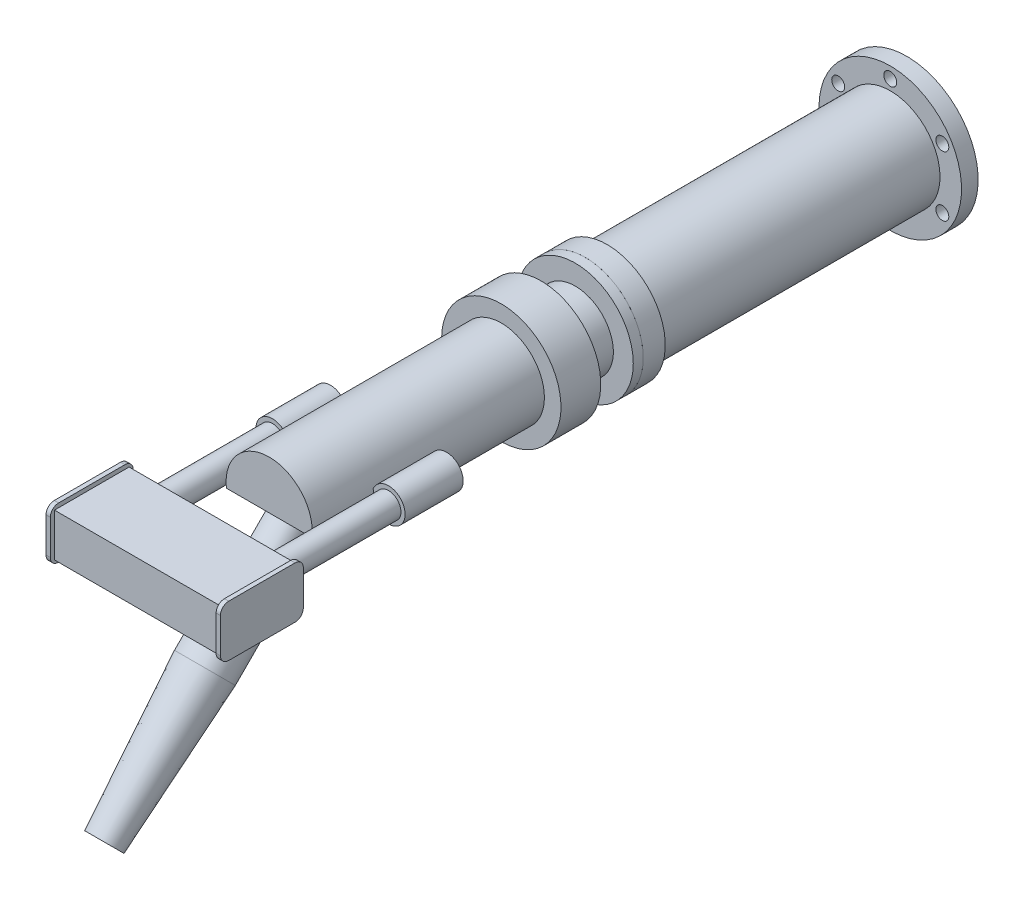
ISO-10303-21;
HEADER;
FILE_DESCRIPTION(('STEP AP214'),'2;1');
FILE_NAME('part.step','',(''),(''),'','','');
FILE_SCHEMA(('AUTOMOTIVE_DESIGN { 1 0 10303 214 1 1 1 1 }'));
ENDSEC;
DATA;
#1=APPLICATION_CONTEXT('core data for automotive mechanical design processes');
#2=APPLICATION_PROTOCOL_DEFINITION('international standard','automotive_design',2000,#1);
#3=PRODUCT_CONTEXT('',#1,'mechanical');
#4=PRODUCT('Part','Part','',(#3));
#5=PRODUCT_RELATED_PRODUCT_CATEGORY('part','',(#4));
#6=PRODUCT_DEFINITION_FORMATION('','',#4);
#7=PRODUCT_DEFINITION_CONTEXT('part definition',#1,'design');
#8=PRODUCT_DEFINITION('design','',#6,#7);
#9=PRODUCT_DEFINITION_SHAPE('','',#8);
#10=(LENGTH_UNIT() NAMED_UNIT(*) SI_UNIT(.MILLI.,.METRE.));
#11=(NAMED_UNIT(*) PLANE_ANGLE_UNIT() SI_UNIT($,.RADIAN.));
#12=(NAMED_UNIT(*) SI_UNIT($,.STERADIAN.) SOLID_ANGLE_UNIT());
#13=UNCERTAINTY_MEASURE_WITH_UNIT(LENGTH_MEASURE(1.E-05),#10,'distance_accuracy_value','');
#14=(GEOMETRIC_REPRESENTATION_CONTEXT(3) GLOBAL_UNCERTAINTY_ASSIGNED_CONTEXT((#13)) GLOBAL_UNIT_ASSIGNED_CONTEXT((#10,
#11,#12)) REPRESENTATION_CONTEXT('',''));
#15=CARTESIAN_POINT('',(0.,0.,0.));
#16=DIRECTION('',(0.,0.,1.));
#17=DIRECTION('',(1.,0.,0.));
#18=AXIS2_PLACEMENT_3D('',#15,#16,#17);
#19=CARTESIAN_POINT('',(0.,0.,-50.673));
#20=DIRECTION('',(0.,0.,-1.));
#21=DIRECTION('',(-1.,0.,0.));
#22=AXIS2_PLACEMENT_3D('',#19,#20,#21);
#23=PLANE('',#22);
#24=CARTESIAN_POINT('',(0.,0.,-50.673));
#25=DIRECTION('',(0.,0.,-1.));
#26=DIRECTION('',(-1.,0.,0.));
#27=AXIS2_PLACEMENT_3D('',#24,#25,#26);
#28=CIRCLE('',#27,44.45);
#29=CARTESIAN_POINT('',(-44.4500000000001,0.,-50.673));
#30=VERTEX_POINT('',#29);
#31=EDGE_CURVE('E11',#30,#30,#28,.T.);
#32=ORIENTED_EDGE('',*,*,#31,.T.);
#33=EDGE_LOOP('',(#32));
#34=FACE_BOUND('',#33,.T.);
#35=CARTESIAN_POINT('',(0.,0.,-50.673));
#36=DIRECTION('',(0.,0.,-1.));
#37=DIRECTION('',(-1.,0.,0.));
#38=AXIS2_PLACEMENT_3D('',#35,#36,#37);
#39=CIRCLE('',#38,38.1);
#40=CARTESIAN_POINT('',(-38.1000000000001,0.,-50.673));
#41=VERTEX_POINT('',#40);
#42=EDGE_CURVE('E50',#41,#41,#39,.T.);
#43=ORIENTED_EDGE('',*,*,#42,.F.);
#44=EDGE_LOOP('',(#43));
#45=FACE_BOUND('',#44,.T.);
#46=ADVANCED_FACE('F35',(#34,#45),#23,.T.);
#47=CARTESIAN_POINT('',(0.,0.,-50.673));
#48=DIRECTION('',(0.,0.,1.));
#49=DIRECTION('',(1.,0.,0.));
#50=AXIS2_PLACEMENT_3D('',#47,#48,#49);
#51=CYLINDRICAL_SURFACE('',#50,44.45);
#52=ORIENTED_EDGE('',*,*,#31,.F.);
#53=EDGE_LOOP('',(#52));
#54=FACE_BOUND('',#53,.T.);
#55=CARTESIAN_POINT('',(0.,0.,-33.782));
#56=DIRECTION('',(0.,0.,-1.));
#57=DIRECTION('',(-1.,0.,0.));
#58=AXIS2_PLACEMENT_3D('',#55,#56,#57);
#59=CIRCLE('',#58,44.45);
#60=CARTESIAN_POINT('',(-44.4500000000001,0.,-33.782));
#61=VERTEX_POINT('',#60);
#62=EDGE_CURVE('E42',#61,#61,#59,.T.);
#63=ORIENTED_EDGE('',*,*,#62,.T.);
#64=EDGE_LOOP('',(#63));
#65=FACE_BOUND('',#64,.T.);
#66=ADVANCED_FACE('F37',(#54,#65),#51,.T.);
#67=CARTESIAN_POINT('',(0.,0.,-33.782));
#68=DIRECTION('',(0.,0.,-1.));
#69=DIRECTION('',(-1.,0.,0.));
#70=AXIS2_PLACEMENT_3D('',#67,#68,#69);
#71=PLANE('',#70);
#72=ORIENTED_EDGE('',*,*,#62,.F.);
#73=EDGE_LOOP('',(#72));
#74=FACE_BOUND('',#73,.T.);
#75=ADVANCED_FACE('F134',(#74),#71,.F.);
#76=CARTESIAN_POINT('',(-2.22044604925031E-12,0.,-267.462));
#77=DIRECTION('',(0.,0.,1.));
#78=DIRECTION('',(1.,0.,0.));
#79=AXIS2_PLACEMENT_3D('',#76,#77,#78);
#80=CYLINDRICAL_SURFACE('',#79,38.1);
#81=CARTESIAN_POINT('',(-2.22044604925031E-12,0.,-267.462));
#82=DIRECTION('',(0.,0.,-1.));
#83=DIRECTION('',(-1.,0.,0.));
#84=AXIS2_PLACEMENT_3D('',#81,#82,#83);
#85=CIRCLE('',#84,38.1);
#86=CARTESIAN_POINT('',(-38.1000000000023,0.,-267.462));
#87=VERTEX_POINT('',#86);
#88=EDGE_CURVE('E46',#87,#87,#85,.T.);
#89=ORIENTED_EDGE('',*,*,#88,.F.);
#90=EDGE_LOOP('',(#89));
#91=FACE_BOUND('',#90,.T.);
#92=ORIENTED_EDGE('',*,*,#42,.T.);
#93=EDGE_LOOP('',(#92));
#94=FACE_BOUND('',#93,.T.);
#95=ADVANCED_FACE('F127',(#91,#94),#80,.T.);
#96=CARTESIAN_POINT('',(-2.22044604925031E-12,0.,-267.462));
#97=DIRECTION('',(0.,0.,-1.));
#98=DIRECTION('',(-1.,0.,0.));
#99=AXIS2_PLACEMENT_3D('',#96,#97,#98);
#100=PLANE('',#99);
#101=CARTESIAN_POINT('',(39.8696445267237,23.0187500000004,-267.462));
#102=DIRECTION('',(0.,0.,-1.));
#103=DIRECTION('',(-1.,0.,0.));
#104=AXIS2_PLACEMENT_3D('',#101,#102,#103);
#105=CIRCLE('',#104,4.9657);
#106=CARTESIAN_POINT('',(34.9039445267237,23.0187500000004,-267.462));
#107=VERTEX_POINT('',#106);
#108=EDGE_CURVE('E91',#107,#107,#105,.F.);
#109=ORIENTED_EDGE('',*,*,#108,.F.);
#110=EDGE_LOOP('',(#109));
#111=FACE_BOUND('',#110,.T.);
#112=CARTESIAN_POINT('',(39.8696445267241,-23.0187499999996,-267.462));
#113=DIRECTION('',(0.,0.,-1.));
#114=DIRECTION('',(-1.,0.,0.));
#115=AXIS2_PLACEMENT_3D('',#112,#113,#114);
#116=CIRCLE('',#115,4.9657);
#117=CARTESIAN_POINT('',(34.9039445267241,-23.0187499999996,-267.462));
#118=VERTEX_POINT('',#117);
#119=EDGE_CURVE('E85',#118,#118,#116,.F.);
#120=ORIENTED_EDGE('',*,*,#119,.F.);
#121=EDGE_LOOP('',(#120));
#122=FACE_BOUND('',#121,.T.);
#123=CARTESIAN_POINT('',(-1.77635683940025E-12,-46.0375,-267.462));
#124=DIRECTION('',(0.,0.,-1.));
#125=DIRECTION('',(-1.,0.,0.));
#126=AXIS2_PLACEMENT_3D('',#123,#124,#125);
#127=CIRCLE('',#126,4.9657);
#128=CARTESIAN_POINT('',(-4.96570000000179,-46.0375,-267.462));
#129=VERTEX_POINT('',#128);
#130=EDGE_CURVE('E79',#129,#129,#127,.F.);
#131=ORIENTED_EDGE('',*,*,#130,.F.);
#132=EDGE_LOOP('',(#131));
#133=FACE_BOUND('',#132,.T.);
#134=CARTESIAN_POINT('',(-39.8696445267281,-23.0187500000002,-267.462));
#135=DIRECTION('',(0.,0.,-1.));
#136=DIRECTION('',(-1.,0.,0.));
#137=AXIS2_PLACEMENT_3D('',#134,#135,#136);
#138=CIRCLE('',#137,4.9657);
#139=CARTESIAN_POINT('',(-44.8353445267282,-23.0187500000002,-267.462));
#140=VERTEX_POINT('',#139);
#141=EDGE_CURVE('E73',#140,#140,#138,.F.);
#142=ORIENTED_EDGE('',*,*,#141,.F.);
#143=EDGE_LOOP('',(#142));
#144=FACE_BOUND('',#143,.T.);
#145=CARTESIAN_POINT('',(-39.8696445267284,23.0187499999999,-267.462));
#146=DIRECTION('',(0.,0.,-1.));
#147=DIRECTION('',(-1.,0.,0.));
#148=AXIS2_PLACEMENT_3D('',#145,#146,#147);
#149=CIRCLE('',#148,4.9657);
#150=CARTESIAN_POINT('',(-44.8353445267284,23.0187499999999,-267.462));
#151=VERTEX_POINT('',#150);
#152=EDGE_CURVE('E67',#151,#151,#149,.F.);
#153=ORIENTED_EDGE('',*,*,#152,.F.);
#154=EDGE_LOOP('',(#153));
#155=FACE_BOUND('',#154,.T.);
#156=CARTESIAN_POINT('',(-2.22044604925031E-12,46.0375,-267.462));
#157=DIRECTION('',(0.,0.,-1.));
#158=DIRECTION('',(-1.,0.,0.));
#159=AXIS2_PLACEMENT_3D('',#156,#157,#158);
#160=CIRCLE('',#159,4.9657);
#161=CARTESIAN_POINT('',(-4.96570000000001,46.0375,-267.462));
#162=VERTEX_POINT('',#161);
#163=EDGE_CURVE('E61',#162,#162,#160,.F.);
#164=ORIENTED_EDGE('',*,*,#163,.F.);
#165=EDGE_LOOP('',(#164));
#166=FACE_BOUND('',#165,.T.);
#167=CARTESIAN_POINT('',(-2.22044604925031E-12,0.,-267.462));
#168=DIRECTION('',(0.,0.,-1.));
#169=DIRECTION('',(-1.,0.,0.));
#170=AXIS2_PLACEMENT_3D('',#167,#168,#169);
#171=CIRCLE('',#170,54.61);
#172=CARTESIAN_POINT('',(-54.6100000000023,0.,-267.462));
#173=VERTEX_POINT('',#172);
#174=EDGE_CURVE('E58',#173,#173,#171,.T.);
#175=ORIENTED_EDGE('',*,*,#174,.F.);
#176=EDGE_LOOP('',(#175));
#177=FACE_BOUND('',#176,.T.);
#178=ORIENTED_EDGE('',*,*,#88,.T.);
#179=EDGE_LOOP('',(#178));
#180=FACE_BOUND('',#179,.T.);
#181=ADVANCED_FACE('F121',(#111,#122,#133,#144,#155,#166,#177,#180),#100,.F.);
#182=CARTESIAN_POINT('',(-2.22044604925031E-12,0.,-280.162));
#183=DIRECTION('',(0.,0.,1.));
#184=DIRECTION('',(1.,0.,0.));
#185=AXIS2_PLACEMENT_3D('',#182,#183,#184);
#186=CYLINDRICAL_SURFACE('',#185,54.61);
#187=CARTESIAN_POINT('',(-2.22044604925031E-12,0.,-280.162));
#188=DIRECTION('',(0.,0.,-1.));
#189=DIRECTION('',(-1.,0.,0.));
#190=AXIS2_PLACEMENT_3D('',#187,#188,#189);
#191=CIRCLE('',#190,54.61);
#192=CARTESIAN_POINT('',(-54.6100000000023,0.,-280.162));
#193=VERTEX_POINT('',#192);
#194=EDGE_CURVE('E55',#193,#193,#191,.T.);
#195=ORIENTED_EDGE('',*,*,#194,.F.);
#196=EDGE_LOOP('',(#195));
#197=FACE_BOUND('',#196,.T.);
#198=ORIENTED_EDGE('',*,*,#174,.T.);
#199=EDGE_LOOP('',(#198));
#200=FACE_BOUND('',#199,.T.);
#201=ADVANCED_FACE('F105',(#197,#200),#186,.T.);
#202=CARTESIAN_POINT('',(-2.22044604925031E-12,0.,-280.162));
#203=DIRECTION('',(0.,0.,-1.));
#204=DIRECTION('',(-1.,0.,0.));
#205=AXIS2_PLACEMENT_3D('',#202,#203,#204);
#206=PLANE('',#205);
#207=CARTESIAN_POINT('',(39.8696445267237,23.0187500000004,-280.162));
#208=DIRECTION('',(0.,0.,-1.));
#209=DIRECTION('',(-0.500000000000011,0.866025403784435,0.));
#210=AXIS2_PLACEMENT_3D('',#207,#208,#209);
#211=CIRCLE('',#210,4.9657);
#212=CARTESIAN_POINT('',(37.3867945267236,27.3191723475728,-280.162));
#213=VERTEX_POINT('',#212);
#214=EDGE_CURVE('E94',#213,#213,#211,.T.);
#215=ORIENTED_EDGE('',*,*,#214,.F.);
#216=EDGE_LOOP('',(#215));
#217=FACE_BOUND('',#216,.T.);
#218=CARTESIAN_POINT('',(39.8696445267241,-23.0187499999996,-280.162));
#219=DIRECTION('',(0.,0.,-1.));
#220=DIRECTION('',(0.499999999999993,0.866025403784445,0.));
#221=AXIS2_PLACEMENT_3D('',#218,#219,#220);
#222=CIRCLE('',#221,4.9657);
#223=CARTESIAN_POINT('',(42.3524945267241,-18.7183276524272,-280.162));
#224=VERTEX_POINT('',#223);
#225=EDGE_CURVE('E88',#224,#224,#222,.T.);
#226=ORIENTED_EDGE('',*,*,#225,.F.);
#227=EDGE_LOOP('',(#226));
#228=FACE_BOUND('',#227,.T.);
#229=CARTESIAN_POINT('',(-1.77635683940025E-12,-46.0375,-280.162));
#230=DIRECTION('',(0.,0.,-1.));
#231=DIRECTION('',(1.,0.,0.));
#232=AXIS2_PLACEMENT_3D('',#229,#230,#231);
#233=CIRCLE('',#232,4.9657);
#234=CARTESIAN_POINT('',(4.96569999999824,-46.0374999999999,-280.162));
#235=VERTEX_POINT('',#234);
#236=EDGE_CURVE('E82',#235,#235,#233,.T.);
#237=ORIENTED_EDGE('',*,*,#236,.F.);
#238=EDGE_LOOP('',(#237));
#239=FACE_BOUND('',#238,.T.);
#240=CARTESIAN_POINT('',(-39.8696445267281,-23.0187500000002,-280.162));
#241=DIRECTION('',(0.,0.,-1.));
#242=DIRECTION('',(0.500000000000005,-0.866025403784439,0.));
#243=AXIS2_PLACEMENT_3D('',#240,#241,#242);
#244=CIRCLE('',#243,4.9657);
#245=CARTESIAN_POINT('',(-37.3867945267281,-27.3191723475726,-280.162));
#246=VERTEX_POINT('',#245);
#247=EDGE_CURVE('E76',#246,#246,#244,.T.);
#248=ORIENTED_EDGE('',*,*,#247,.F.);
#249=EDGE_LOOP('',(#248));
#250=FACE_BOUND('',#249,.T.);
#251=CARTESIAN_POINT('',(-39.8696445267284,23.0187499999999,-280.162));
#252=DIRECTION('',(0.,0.,-1.));
#253=DIRECTION('',(-0.499999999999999,-0.866025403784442,0.));
#254=AXIS2_PLACEMENT_3D('',#251,#252,#253);
#255=CIRCLE('',#254,4.9657);
#256=CARTESIAN_POINT('',(-42.3524945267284,18.7183276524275,-280.162));
#257=VERTEX_POINT('',#256);
#258=EDGE_CURVE('E70',#257,#257,#255,.T.);
#259=ORIENTED_EDGE('',*,*,#258,.F.);
#260=EDGE_LOOP('',(#259));
#261=FACE_BOUND('',#260,.T.);
#262=CARTESIAN_POINT('',(-2.22044604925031E-12,46.0375,-280.162));
#263=DIRECTION('',(0.,0.,-1.));
#264=DIRECTION('',(-1.,0.,0.));
#265=AXIS2_PLACEMENT_3D('',#262,#263,#264);
#266=CIRCLE('',#265,4.9657);
#267=CARTESIAN_POINT('',(-4.96570000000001,46.0375,-280.162));
#268=VERTEX_POINT('',#267);
#269=EDGE_CURVE('E64',#268,#268,#266,.T.);
#270=ORIENTED_EDGE('',*,*,#269,.F.);
#271=EDGE_LOOP('',(#270));
#272=FACE_BOUND('',#271,.T.);
#273=ORIENTED_EDGE('',*,*,#194,.T.);
#274=EDGE_LOOP('',(#273));
#275=FACE_BOUND('',#274,.T.);
#276=ADVANCED_FACE('F101',(#217,#228,#239,#250,#261,#272,#275),#206,.T.);
#277=CARTESIAN_POINT('',(0.,46.0375,343.253731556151));
#278=DIRECTION('',(0.,0.,-1.));
#279=DIRECTION('',(-1.,0.,0.));
#280=AXIS2_PLACEMENT_3D('',#277,#278,#279);
#281=CYLINDRICAL_SURFACE('',#280,4.9657);
#282=CARTESIAN_POINT('',(-4.96570000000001,46.0375,-280.162));
#283=CARTESIAN_POINT('',(-4.96570000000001,46.0375,-280.029708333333));
#284=CARTESIAN_POINT('',(-4.96570000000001,46.0375,-279.897416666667));
#285=CARTESIAN_POINT('',(-4.96570000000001,46.0375,-279.632833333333));
#286=CARTESIAN_POINT('',(-4.96570000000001,46.0375,-279.500541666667));
#287=CARTESIAN_POINT('',(-4.96570000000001,46.0375,-279.235958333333));
#288=CARTESIAN_POINT('',(-4.96570000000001,46.0375,-279.103666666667));
#289=CARTESIAN_POINT('',(-4.96570000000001,46.0375,-278.839083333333));
#290=CARTESIAN_POINT('',(-4.96570000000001,46.0375,-278.706791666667));
#291=CARTESIAN_POINT('',(-4.96570000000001,46.0375,-278.442208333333));
#292=CARTESIAN_POINT('',(-4.96570000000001,46.0375,-278.309916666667));
#293=CARTESIAN_POINT('',(-4.96570000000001,46.0375,-278.045333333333));
#294=CARTESIAN_POINT('',(-4.96570000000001,46.0375,-277.913041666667));
#295=CARTESIAN_POINT('',(-4.96570000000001,46.0375,-277.648458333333));
#296=CARTESIAN_POINT('',(-4.96570000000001,46.0375,-277.516166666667));
#297=CARTESIAN_POINT('',(-4.96570000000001,46.0375,-277.251583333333));
#298=CARTESIAN_POINT('',(-4.96570000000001,46.0375,-277.119291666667));
#299=CARTESIAN_POINT('',(-4.96570000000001,46.0375,-276.854708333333));
#300=CARTESIAN_POINT('',(-4.96570000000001,46.0375,-276.722416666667));
#301=CARTESIAN_POINT('',(-4.96570000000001,46.0375,-276.457833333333));
#302=CARTESIAN_POINT('',(-4.96570000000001,46.0375,-276.325541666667));
#303=CARTESIAN_POINT('',(-4.96570000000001,46.0375,-276.060958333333));
#304=CARTESIAN_POINT('',(-4.96570000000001,46.0375,-275.928666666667));
#305=CARTESIAN_POINT('',(-4.96570000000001,46.0375,-275.664083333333));
#306=CARTESIAN_POINT('',(-4.96570000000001,46.0375,-275.531791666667));
#307=CARTESIAN_POINT('',(-4.96570000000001,46.0375,-275.267208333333));
#308=CARTESIAN_POINT('',(-4.96570000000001,46.0375,-275.134916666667));
#309=CARTESIAN_POINT('',(-4.96570000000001,46.0375,-274.870333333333));
#310=CARTESIAN_POINT('',(-4.96570000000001,46.0375,-274.738041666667));
#311=CARTESIAN_POINT('',(-4.96570000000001,46.0375,-274.473458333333));
#312=CARTESIAN_POINT('',(-4.96570000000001,46.0375,-274.341166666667));
#313=CARTESIAN_POINT('',(-4.96570000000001,46.0375,-274.076583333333));
#314=CARTESIAN_POINT('',(-4.96570000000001,46.0375,-273.944291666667));
#315=CARTESIAN_POINT('',(-4.96570000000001,46.0375,-273.679708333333));
#316=CARTESIAN_POINT('',(-4.96570000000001,46.0375,-273.547416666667));
#317=CARTESIAN_POINT('',(-4.96570000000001,46.0375,-273.282833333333));
#318=CARTESIAN_POINT('',(-4.96570000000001,46.0375,-273.150541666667));
#319=CARTESIAN_POINT('',(-4.96570000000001,46.0375,-272.885958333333));
#320=CARTESIAN_POINT('',(-4.96570000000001,46.0375,-272.753666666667));
#321=CARTESIAN_POINT('',(-4.96570000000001,46.0375,-272.489083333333));
#322=CARTESIAN_POINT('',(-4.96570000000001,46.0375,-272.356791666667));
#323=CARTESIAN_POINT('',(-4.96570000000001,46.0375,-272.092208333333));
#324=CARTESIAN_POINT('',(-4.96570000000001,46.0375,-271.959916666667));
#325=CARTESIAN_POINT('',(-4.96570000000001,46.0375,-271.695333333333));
#326=CARTESIAN_POINT('',(-4.96570000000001,46.0375,-271.563041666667));
#327=CARTESIAN_POINT('',(-4.96570000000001,46.0375,-271.298458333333));
#328=CARTESIAN_POINT('',(-4.96570000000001,46.0375,-271.166166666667));
#329=CARTESIAN_POINT('',(-4.96570000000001,46.0375,-270.901583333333));
#330=CARTESIAN_POINT('',(-4.96570000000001,46.0375,-270.769291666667));
#331=CARTESIAN_POINT('',(-4.96570000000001,46.0375,-270.504708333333));
#332=CARTESIAN_POINT('',(-4.96570000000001,46.0375,-270.372416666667));
#333=CARTESIAN_POINT('',(-4.96570000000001,46.0375,-270.107833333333));
#334=CARTESIAN_POINT('',(-4.96570000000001,46.0375,-269.975541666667));
#335=CARTESIAN_POINT('',(-4.96570000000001,46.0375,-269.710958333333));
#336=CARTESIAN_POINT('',(-4.96570000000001,46.0375,-269.578666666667));
#337=CARTESIAN_POINT('',(-4.96570000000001,46.0375,-269.314083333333));
#338=CARTESIAN_POINT('',(-4.96570000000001,46.0375,-269.181791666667));
#339=CARTESIAN_POINT('',(-4.96570000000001,46.0375,-268.917208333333));
#340=CARTESIAN_POINT('',(-4.96570000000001,46.0375,-268.784916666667));
#341=CARTESIAN_POINT('',(-4.96570000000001,46.0375,-268.520333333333));
#342=CARTESIAN_POINT('',(-4.96570000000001,46.0375,-268.388041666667));
#343=CARTESIAN_POINT('',(-4.96570000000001,46.0375,-268.123458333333));
#344=CARTESIAN_POINT('',(-4.96570000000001,46.0375,-267.991166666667));
#345=CARTESIAN_POINT('',(-4.96570000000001,46.0375,-267.726583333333));
#346=CARTESIAN_POINT('',(-4.96570000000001,46.0375,-267.594291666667));
#347=CARTESIAN_POINT('',(-4.96570000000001,46.0375,-267.462));
#348=B_SPLINE_CURVE_WITH_KNOTS('',3,(#282,#283,#284,#285,#286,#287,#288,#289,#290,#291,#292,
#293,#294,#295,#296,#297,#298,#299,#300,#301,#302,#303,#304,#305,#306,#307,#308,#309,#310,#311,
#312,#313,#314,#315,#316,#317,#318,#319,#320,#321,#322,#323,#324,#325,#326,#327,#328,#329,#330,
#331,#332,#333,#334,#335,#336,#337,#338,#339,#340,#341,#342,#343,#344,#345,#346,#347),
.UNSPECIFIED.,.F.,.F.,(4,2,2,2,2,2,2,2,2,2,2,2,2,2,2,2,2,2,2,2,2,2,2,2,2,2,2,2,2,2,2,2,4),(0.,
0.396874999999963,0.793750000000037,1.190625,1.58749999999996,1.98437500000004,2.38125,
2.77812499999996,3.17499999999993,3.571875,3.96874999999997,4.36562499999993,4.7625,
5.15937499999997,5.55624999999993,5.953125,6.34999999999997,6.74687499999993,7.14375,
7.54062499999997,7.93749999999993,8.334375,8.73124999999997,9.12812499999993,9.52500000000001,
9.92187499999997,10.3187499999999,10.7156249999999,11.1125,11.5093749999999,11.9062499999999,
12.303125,12.6999999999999),.UNSPECIFIED.);
#349=EDGE_CURVE('BSEAM104',#268,#162,#348,.T.);
#350=ORIENTED_EDGE('',*,*,#269,.T.);
#351=ORIENTED_EDGE('',*,*,#163,.T.);
#352=ORIENTED_EDGE('',*,*,#349,.T.);
#353=ORIENTED_EDGE('',*,*,#349,.F.);
#354=EDGE_LOOP('',(#350,#352,#351,#353));
#355=FACE_BOUND('',#354,.T.);
#356=ADVANCED_FACE('F104',(#355),#281,.F.);
#357=CARTESIAN_POINT('',(-39.8696445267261,23.0187499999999,-33.7810000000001));
#358=DIRECTION('',(0.,0.,-1.));
#359=DIRECTION('',(-1.,0.,0.));
#360=AXIS2_PLACEMENT_3D('',#357,#358,#359);
#361=CYLINDRICAL_SURFACE('',#360,4.9657);
#362=ORIENTED_EDGE('',*,*,#258,.T.);
#363=EDGE_LOOP('',(#362));
#364=FACE_BOUND('',#363,.T.);
#365=ORIENTED_EDGE('',*,*,#152,.T.);
#366=EDGE_LOOP('',(#365));
#367=FACE_BOUND('',#366,.T.);
#368=ADVANCED_FACE('F149',(#364,#367),#361,.F.);
#369=CARTESIAN_POINT('',(-39.8696445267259,-23.0187500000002,-33.7810000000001));
#370=DIRECTION('',(0.,0.,-1.));
#371=DIRECTION('',(-1.,0.,0.));
#372=AXIS2_PLACEMENT_3D('',#369,#370,#371);
#373=CYLINDRICAL_SURFACE('',#372,4.9657);
#374=ORIENTED_EDGE('',*,*,#247,.T.);
#375=EDGE_LOOP('',(#374));
#376=FACE_BOUND('',#375,.T.);
#377=ORIENTED_EDGE('',*,*,#141,.T.);
#378=EDGE_LOOP('',(#377));
#379=FACE_BOUND('',#378,.T.);
#380=ADVANCED_FACE('F153',(#376,#379),#373,.F.);
#381=CARTESIAN_POINT('',(2.22044604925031E-13,-46.0375,-33.7810000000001));
#382=DIRECTION('',(0.,0.,-1.));
#383=DIRECTION('',(-1.,0.,0.));
#384=AXIS2_PLACEMENT_3D('',#381,#382,#383);
#385=CYLINDRICAL_SURFACE('',#384,4.9657);
#386=ORIENTED_EDGE('',*,*,#236,.T.);
#387=EDGE_LOOP('',(#386));
#388=FACE_BOUND('',#387,.T.);
#389=ORIENTED_EDGE('',*,*,#130,.T.);
#390=EDGE_LOOP('',(#389));
#391=FACE_BOUND('',#390,.T.);
#392=ADVANCED_FACE('F157',(#388,#391),#385,.F.);
#393=CARTESIAN_POINT('',(39.8696445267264,-23.0187499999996,-33.7810000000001));
#394=DIRECTION('',(0.,0.,-1.));
#395=DIRECTION('',(-1.,0.,0.));
#396=AXIS2_PLACEMENT_3D('',#393,#394,#395);
#397=CYLINDRICAL_SURFACE('',#396,4.9657);
#398=ORIENTED_EDGE('',*,*,#225,.T.);
#399=EDGE_LOOP('',(#398));
#400=FACE_BOUND('',#399,.T.);
#401=ORIENTED_EDGE('',*,*,#119,.T.);
#402=EDGE_LOOP('',(#401));
#403=FACE_BOUND('',#402,.T.);
#404=ADVANCED_FACE('F161',(#400,#403),#397,.F.);
#405=CARTESIAN_POINT('',(39.8696445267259,23.0187500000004,-33.7810000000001));
#406=DIRECTION('',(0.,0.,-1.));
#407=DIRECTION('',(-1.,0.,0.));
#408=AXIS2_PLACEMENT_3D('',#405,#406,#407);
#409=CYLINDRICAL_SURFACE('',#408,4.9657);
#410=ORIENTED_EDGE('',*,*,#214,.T.);
#411=EDGE_LOOP('',(#410));
#412=FACE_BOUND('',#411,.T.);
#413=ORIENTED_EDGE('',*,*,#108,.T.);
#414=EDGE_LOOP('',(#413));
#415=FACE_BOUND('',#414,.T.);
#416=ADVANCED_FACE('F98',(#412,#415),#409,.F.);
#417=CLOSED_SHELL('',(#46,#66,#75,#95,#181,#201,#276,#356,#368,#380,#392,#404,#416));
#418=MANIFOLD_SOLID_BREP('B2',#417);
#419=CARTESIAN_POINT('',(-66.802,13.335,306.07));
#420=DIRECTION('',(1.,0.,0.));
#421=DIRECTION('',(0.,0.,1.));
#422=AXIS2_PLACEMENT_3D('',#419,#420,#421);
#423=CYLINDRICAL_SURFACE('',#422,6.34999999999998);
#424=CARTESIAN_POINT('',(-63.5000000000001,13.335,306.07));
#425=DIRECTION('',(1.,0.,0.));
#426=DIRECTION('',(0.,0.,1.));
#427=AXIS2_PLACEMENT_3D('',#424,#425,#426);
#428=CIRCLE('',#427,6.34999999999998);
#429=CARTESIAN_POINT('',(-63.5000000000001,19.685,306.07));
#430=VERTEX_POINT('',#429);
#431=CARTESIAN_POINT('',(-63.5000000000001,13.335,312.42));
#432=VERTEX_POINT('',#431);
#433=EDGE_CURVE('E289',#430,#432,#428,.T.);
#434=ORIENTED_EDGE('',*,*,#433,.F.);
#435=DIRECTION('',(1.,0.,0.));
#436=VECTOR('',#435,1.);
#437=CARTESIAN_POINT('',(-66.802,19.685,306.07));
#438=LINE('',#437,#436);
#439=CARTESIAN_POINT('',(-66.802,19.685,306.07));
#440=VERTEX_POINT('',#439);
#441=EDGE_CURVE('E332',#440,#430,#438,.T.);
#442=ORIENTED_EDGE('',*,*,#441,.F.);
#443=CARTESIAN_POINT('',(-66.802,13.335,306.07));
#444=DIRECTION('',(1.,0.,0.));
#445=DIRECTION('',(0.,0.,1.));
#446=AXIS2_PLACEMENT_3D('',#443,#444,#445);
#447=CIRCLE('',#446,6.34999999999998);
#448=CARTESIAN_POINT('',(-66.802,13.335,312.42));
#449=VERTEX_POINT('',#448);
#450=EDGE_CURVE('E294',#440,#449,#447,.T.);
#451=ORIENTED_EDGE('',*,*,#450,.T.);
#452=DIRECTION('',(1.,0.,0.));
#453=VECTOR('',#452,1.);
#454=CARTESIAN_POINT('',(-66.802,13.335,312.42));
#455=LINE('',#454,#453);
#456=EDGE_CURVE('E33',#449,#432,#455,.T.);
#457=ORIENTED_EDGE('',*,*,#456,.T.);
#458=EDGE_LOOP('',(#434,#442,#451,#457));
#459=FACE_BOUND('',#458,.T.);
#460=ADVANCED_FACE('F217',(#459),#423,.T.);
#461=CARTESIAN_POINT('',(-66.802,13.335,312.42));
#462=DIRECTION('',(0.,0.,-1.));
#463=DIRECTION('',(1.,0.,0.));
#464=AXIS2_PLACEMENT_3D('',#461,#462,#463);
#465=PLANE('',#464);
#466=DIRECTION('',(0.,-1.,0.));
#467=VECTOR('',#466,1.);
#468=CARTESIAN_POINT('',(-63.5000000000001,13.335,312.42));
#469=LINE('',#468,#467);
#470=CARTESIAN_POINT('',(-63.5000000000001,-13.335,312.42));
#471=VERTEX_POINT('',#470);
#472=EDGE_CURVE('E280',#432,#471,#469,.T.);
#473=ORIENTED_EDGE('',*,*,#472,.F.);
#474=ORIENTED_EDGE('',*,*,#456,.F.);
#475=DIRECTION('',(0.,-1.,0.));
#476=VECTOR('',#475,1.);
#477=CARTESIAN_POINT('',(-66.802,13.335,312.42));
#478=LINE('',#477,#476);
#479=CARTESIAN_POINT('',(-66.802,-13.335,312.42));
#480=VERTEX_POINT('',#479);
#481=EDGE_CURVE('E314',#449,#480,#478,.T.);
#482=ORIENTED_EDGE('',*,*,#481,.T.);
#483=DIRECTION('',(1.,0.,0.));
#484=VECTOR('',#483,1.);
#485=CARTESIAN_POINT('',(-66.802,-13.335,312.42));
#486=LINE('',#485,#484);
#487=EDGE_CURVE('E224',#480,#471,#486,.T.);
#488=ORIENTED_EDGE('',*,*,#487,.T.);
#489=EDGE_LOOP('',(#473,#474,#482,#488));
#490=FACE_BOUND('',#489,.T.);
#491=ADVANCED_FACE('F281',(#490),#465,.F.);
#492=CARTESIAN_POINT('',(-66.802,-13.335,306.07));
#493=DIRECTION('',(1.,0.,0.));
#494=DIRECTION('',(0.,0.,1.));
#495=AXIS2_PLACEMENT_3D('',#492,#493,#494);
#496=CYLINDRICAL_SURFACE('',#495,6.34999999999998);
#497=CARTESIAN_POINT('',(-63.5000000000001,-13.335,306.07));
#498=DIRECTION('',(1.,0.,0.));
#499=DIRECTION('',(0.,0.,-1.));
#500=AXIS2_PLACEMENT_3D('',#497,#498,#499);
#501=CIRCLE('',#500,6.34999999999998);
#502=CARTESIAN_POINT('',(-63.5000000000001,-19.685,306.07));
#503=VERTEX_POINT('',#502);
#504=EDGE_CURVE('E288',#471,#503,#501,.T.);
#505=ORIENTED_EDGE('',*,*,#504,.F.);
#506=ORIENTED_EDGE('',*,*,#487,.F.);
#507=CARTESIAN_POINT('',(-66.802,-13.335,306.07));
#508=DIRECTION('',(1.,0.,0.));
#509=DIRECTION('',(0.,0.,-1.));
#510=AXIS2_PLACEMENT_3D('',#507,#508,#509);
#511=CIRCLE('',#510,6.34999999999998);
#512=CARTESIAN_POINT('',(-66.802,-19.685,306.07));
#513=VERTEX_POINT('',#512);
#514=EDGE_CURVE('E316',#480,#513,#511,.T.);
#515=ORIENTED_EDGE('',*,*,#514,.T.);
#516=DIRECTION('',(1.,0.,0.));
#517=VECTOR('',#516,1.);
#518=CARTESIAN_POINT('',(-66.802,-19.685,306.07));
#519=LINE('',#518,#517);
#520=EDGE_CURVE('E346',#513,#503,#519,.T.);
#521=ORIENTED_EDGE('',*,*,#520,.T.);
#522=EDGE_LOOP('',(#505,#506,#515,#521));
#523=FACE_BOUND('',#522,.T.);
#524=ADVANCED_FACE('F350',(#523),#496,.T.);
#525=CARTESIAN_POINT('',(-66.802,-19.685,306.07));
#526=DIRECTION('',(0.,1.,0.));
#527=DIRECTION('',(0.,0.,1.));
#528=AXIS2_PLACEMENT_3D('',#525,#526,#527);
#529=PLANE('',#528);
#530=DIRECTION('',(0.,0.,-1.));
#531=VECTOR('',#530,1.);
#532=CARTESIAN_POINT('',(-63.5000000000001,-19.685,306.07));
#533=LINE('',#532,#531);
#534=CARTESIAN_POINT('',(-63.5000000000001,-19.685,255.27));
#535=VERTEX_POINT('',#534);
#536=EDGE_CURVE('E301',#503,#535,#533,.T.);
#537=ORIENTED_EDGE('',*,*,#536,.F.);
#538=ORIENTED_EDGE('',*,*,#520,.F.);
#539=DIRECTION('',(0.,0.,-1.));
#540=VECTOR('',#539,1.);
#541=CARTESIAN_POINT('',(-66.802,-19.685,306.07));
#542=LINE('',#541,#540);
#543=CARTESIAN_POINT('',(-66.802,-19.685,255.27));
#544=VERTEX_POINT('',#543);
#545=EDGE_CURVE('E319',#513,#544,#542,.T.);
#546=ORIENTED_EDGE('',*,*,#545,.T.);
#547=DIRECTION('',(1.,0.,0.));
#548=VECTOR('',#547,1.);
#549=CARTESIAN_POINT('',(-66.802,-19.685,255.27));
#550=LINE('',#549,#548);
#551=EDGE_CURVE('E343',#544,#535,#550,.T.);
#552=ORIENTED_EDGE('',*,*,#551,.T.);
#553=EDGE_LOOP('',(#537,#538,#546,#552));
#554=FACE_BOUND('',#553,.T.);
#555=ADVANCED_FACE('F352',(#554),#529,.F.);
#556=CARTESIAN_POINT('',(-66.802,-13.335,255.27));
#557=DIRECTION('',(1.,0.,0.));
#558=DIRECTION('',(0.,0.,1.));
#559=AXIS2_PLACEMENT_3D('',#556,#557,#558);
#560=CYLINDRICAL_SURFACE('',#559,6.35000000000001);
#561=CARTESIAN_POINT('',(-63.5000000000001,-13.335,255.27));
#562=DIRECTION('',(1.,0.,0.));
#563=DIRECTION('',(0.,0.,1.));
#564=AXIS2_PLACEMENT_3D('',#561,#562,#563);
#565=CIRCLE('',#564,6.35000000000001);
#566=CARTESIAN_POINT('',(-63.5000000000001,-13.335,248.92));
#567=VERTEX_POINT('',#566);
#568=EDGE_CURVE('E304',#535,#567,#565,.T.);
#569=ORIENTED_EDGE('',*,*,#568,.F.);
#570=ORIENTED_EDGE('',*,*,#551,.F.);
#571=CARTESIAN_POINT('',(-66.802,-13.335,255.27));
#572=DIRECTION('',(1.,0.,0.));
#573=DIRECTION('',(0.,0.,1.));
#574=AXIS2_PLACEMENT_3D('',#571,#572,#573);
#575=CIRCLE('',#574,6.35000000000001);
#576=CARTESIAN_POINT('',(-66.802,-13.335,248.92));
#577=VERTEX_POINT('',#576);
#578=EDGE_CURVE('E322',#544,#577,#575,.T.);
#579=ORIENTED_EDGE('',*,*,#578,.T.);
#580=DIRECTION('',(1.,0.,0.));
#581=VECTOR('',#580,1.);
#582=CARTESIAN_POINT('',(-66.802,-13.335,248.92));
#583=LINE('',#582,#581);
#584=EDGE_CURVE('E340',#577,#567,#583,.T.);
#585=ORIENTED_EDGE('',*,*,#584,.T.);
#586=EDGE_LOOP('',(#569,#570,#579,#585));
#587=FACE_BOUND('',#586,.T.);
#588=ADVANCED_FACE('F355',(#587),#560,.T.);
#589=CARTESIAN_POINT('',(-66.802,-13.335,248.92));
#590=DIRECTION('',(0.,0.,1.));
#591=DIRECTION('',(-1.,0.,0.));
#592=AXIS2_PLACEMENT_3D('',#589,#590,#591);
#593=PLANE('',#592);
#594=DIRECTION('',(0.,1.,0.));
#595=VECTOR('',#594,1.);
#596=CARTESIAN_POINT('',(-63.5000000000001,-13.335,248.92));
#597=LINE('',#596,#595);
#598=CARTESIAN_POINT('',(-63.5000000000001,13.335,248.92));
#599=VERTEX_POINT('',#598);
#600=EDGE_CURVE('E307',#567,#599,#597,.T.);
#601=ORIENTED_EDGE('',*,*,#600,.F.);
#602=ORIENTED_EDGE('',*,*,#584,.F.);
#603=DIRECTION('',(0.,1.,0.));
#604=VECTOR('',#603,1.);
#605=CARTESIAN_POINT('',(-66.802,-13.335,248.92));
#606=LINE('',#605,#604);
#607=CARTESIAN_POINT('',(-66.802,13.335,248.92));
#608=VERTEX_POINT('',#607);
#609=EDGE_CURVE('E325',#577,#608,#606,.T.);
#610=ORIENTED_EDGE('',*,*,#609,.T.);
#611=DIRECTION('',(1.,0.,0.));
#612=VECTOR('',#611,1.);
#613=CARTESIAN_POINT('',(-66.802,13.335,248.92));
#614=LINE('',#613,#612);
#615=EDGE_CURVE('E337',#608,#599,#614,.T.);
#616=ORIENTED_EDGE('',*,*,#615,.T.);
#617=EDGE_LOOP('',(#601,#602,#610,#616));
#618=FACE_BOUND('',#617,.T.);
#619=ADVANCED_FACE('F358',(#618),#593,.F.);
#620=CARTESIAN_POINT('',(-66.802,13.335,255.27));
#621=DIRECTION('',(1.,0.,0.));
#622=DIRECTION('',(0.,0.,1.));
#623=AXIS2_PLACEMENT_3D('',#620,#621,#622);
#624=CYLINDRICAL_SURFACE('',#623,6.35000000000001);
#625=CARTESIAN_POINT('',(-63.5000000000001,13.335,255.27));
#626=DIRECTION('',(1.,0.,0.));
#627=DIRECTION('',(0.,0.,1.));
#628=AXIS2_PLACEMENT_3D('',#625,#626,#627);
#629=CIRCLE('',#628,6.35000000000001);
#630=CARTESIAN_POINT('',(-63.5000000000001,19.6850000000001,255.27));
#631=VERTEX_POINT('',#630);
#632=EDGE_CURVE('E310',#599,#631,#629,.T.);
#633=ORIENTED_EDGE('',*,*,#632,.F.);
#634=ORIENTED_EDGE('',*,*,#615,.F.);
#635=CARTESIAN_POINT('',(-66.802,13.335,255.27));
#636=DIRECTION('',(1.,0.,0.));
#637=DIRECTION('',(0.,0.,1.));
#638=AXIS2_PLACEMENT_3D('',#635,#636,#637);
#639=CIRCLE('',#638,6.35000000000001);
#640=CARTESIAN_POINT('',(-66.802,19.6850000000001,255.27));
#641=VERTEX_POINT('',#640);
#642=EDGE_CURVE('E328',#608,#641,#639,.T.);
#643=ORIENTED_EDGE('',*,*,#642,.T.);
#644=DIRECTION('',(1.,0.,0.));
#645=VECTOR('',#644,1.);
#646=CARTESIAN_POINT('',(-66.802,19.6850000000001,255.27));
#647=LINE('',#646,#645);
#648=EDGE_CURVE('E334',#641,#631,#647,.T.);
#649=ORIENTED_EDGE('',*,*,#648,.T.);
#650=EDGE_LOOP('',(#633,#634,#643,#649));
#651=FACE_BOUND('',#650,.T.);
#652=ADVANCED_FACE('F361',(#651),#624,.T.);
#653=CARTESIAN_POINT('',(-66.802,19.685,255.27));
#654=DIRECTION('',(0.,-1.,0.));
#655=DIRECTION('',(0.,0.,-1.));
#656=AXIS2_PLACEMENT_3D('',#653,#654,#655);
#657=PLANE('',#656);
#658=DIRECTION('',(0.,0.,1.));
#659=VECTOR('',#658,1.);
#660=CARTESIAN_POINT('',(-63.5000000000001,19.685,255.27));
#661=LINE('',#660,#659);
#662=EDGE_CURVE('E297',#631,#430,#661,.T.);
#663=ORIENTED_EDGE('',*,*,#662,.F.);
#664=ORIENTED_EDGE('',*,*,#648,.F.);
#665=DIRECTION('',(0.,0.,1.));
#666=VECTOR('',#665,1.);
#667=CARTESIAN_POINT('',(-66.802,19.685,255.27));
#668=LINE('',#667,#666);
#669=EDGE_CURVE('E231',#641,#440,#668,.T.);
#670=ORIENTED_EDGE('',*,*,#669,.T.);
#671=ORIENTED_EDGE('',*,*,#441,.T.);
#672=EDGE_LOOP('',(#663,#664,#670,#671));
#673=FACE_BOUND('',#672,.T.);
#674=ADVANCED_FACE('F362',(#673),#657,.F.);
#675=CARTESIAN_POINT('',(-66.802,13.335,306.07));
#676=DIRECTION('',(1.,0.,0.));
#677=DIRECTION('',(0.,0.,1.));
#678=AXIS2_PLACEMENT_3D('',#675,#676,#677);
#679=PLANE('',#678);
#680=ORIENTED_EDGE('',*,*,#450,.F.);
#681=ORIENTED_EDGE('',*,*,#669,.F.);
#682=ORIENTED_EDGE('',*,*,#642,.F.);
#683=ORIENTED_EDGE('',*,*,#609,.F.);
#684=ORIENTED_EDGE('',*,*,#578,.F.);
#685=ORIENTED_EDGE('',*,*,#545,.F.);
#686=ORIENTED_EDGE('',*,*,#514,.F.);
#687=ORIENTED_EDGE('',*,*,#481,.F.);
#688=EDGE_LOOP('',(#680,#681,#682,#683,#684,#685,#686,#687));
#689=FACE_BOUND('',#688,.T.);
#690=ADVANCED_FACE('F364',(#689),#679,.F.);
#691=CARTESIAN_POINT('',(-63.5000000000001,13.335,306.07));
#692=DIRECTION('',(1.,0.,0.));
#693=DIRECTION('',(0.,0.,1.));
#694=AXIS2_PLACEMENT_3D('',#691,#692,#693);
#695=PLANE('',#694);
#696=ORIENTED_EDGE('',*,*,#433,.T.);
#697=ORIENTED_EDGE('',*,*,#472,.T.);
#698=ORIENTED_EDGE('',*,*,#504,.T.);
#699=ORIENTED_EDGE('',*,*,#536,.T.);
#700=ORIENTED_EDGE('',*,*,#568,.T.);
#701=ORIENTED_EDGE('',*,*,#600,.T.);
#702=ORIENTED_EDGE('',*,*,#632,.T.);
#703=ORIENTED_EDGE('',*,*,#662,.T.);
#704=EDGE_LOOP('',(#696,#697,#698,#699,#700,#701,#702,#703));
#705=FACE_BOUND('',#704,.T.);
#706=ADVANCED_FACE('F295',(#705),#695,.T.);
#707=CLOSED_SHELL('',(#460,#491,#524,#555,#588,#619,#652,#674,#690,#706));
#708=MANIFOLD_SOLID_BREP('B6',#707);
#709=CARTESIAN_POINT('',(-44.4500000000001,0.,252.095));
#710=DIRECTION('',(0.,0.,-1.));
#711=DIRECTION('',(1.,0.,0.));
#712=AXIS2_PLACEMENT_3D('',#709,#710,#711);
#713=CYLINDRICAL_SURFACE('',#712,9.52500000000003);
#714=CARTESIAN_POINT('',(-44.4500000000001,0.,252.095));
#715=DIRECTION('',(0.,0.,-1.));
#716=DIRECTION('',(-1.,0.,0.));
#717=AXIS2_PLACEMENT_3D('',#714,#715,#716);
#718=CIRCLE('',#717,9.52500000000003);
#719=CARTESIAN_POINT('',(-53.9750000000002,0.,252.095));
#720=VERTEX_POINT('',#719);
#721=EDGE_CURVE('E216',#720,#720,#718,.T.);
#722=ORIENTED_EDGE('',*,*,#721,.T.);
#723=EDGE_LOOP('',(#722));
#724=FACE_BOUND('',#723,.T.);
#725=CARTESIAN_POINT('',(-44.4500000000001,0.,161.29));
#726=DIRECTION('',(0.,0.,-1.));
#727=DIRECTION('',(-1.,0.,0.));
#728=AXIS2_PLACEMENT_3D('',#725,#726,#727);
#729=CIRCLE('',#728,9.52500000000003);
#730=CARTESIAN_POINT('',(-53.9750000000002,0.,161.29));
#731=VERTEX_POINT('',#730);
#732=EDGE_CURVE('E418',#731,#731,#729,.T.);
#733=ORIENTED_EDGE('',*,*,#732,.F.);
#734=EDGE_LOOP('',(#733));
#735=FACE_BOUND('',#734,.T.);
#736=ADVANCED_FACE('F412',(#724,#735),#713,.T.);
#737=CARTESIAN_POINT('',(-44.4500000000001,0.,252.095));
#738=DIRECTION('',(0.,0.,1.));
#739=DIRECTION('',(-1.,0.,0.));
#740=AXIS2_PLACEMENT_3D('',#737,#738,#739);
#741=PLANE('',#740);
#742=ORIENTED_EDGE('',*,*,#721,.F.);
#743=EDGE_LOOP('',(#742));
#744=FACE_BOUND('',#743,.T.);
#745=ADVANCED_FACE('F427',(#744),#741,.T.);
#746=CARTESIAN_POINT('',(-44.4500000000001,0.,161.29));
#747=DIRECTION('',(0.,0.,1.));
#748=DIRECTION('',(-1.,0.,0.));
#749=AXIS2_PLACEMENT_3D('',#746,#747,#748);
#750=PLANE('',#749);
#751=ORIENTED_EDGE('',*,*,#732,.T.);
#752=EDGE_LOOP('',(#751));
#753=FACE_BOUND('',#752,.T.);
#754=ADVANCED_FACE('F424',(#753),#750,.F.);
#755=CLOSED_SHELL('',(#736,#745,#754));
#756=MANIFOLD_SOLID_BREP('B27',#755);
#757=CARTESIAN_POINT('',(-44.4500000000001,0.,161.29));
#758=DIRECTION('',(0.,0.,-1.));
#759=DIRECTION('',(1.,0.,0.));
#760=AXIS2_PLACEMENT_3D('',#757,#758,#759);
#761=CYLINDRICAL_SURFACE('',#760,12.7);
#762=CARTESIAN_POINT('',(-44.4500000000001,0.,161.29));
#763=DIRECTION('',(0.,0.,-1.));
#764=DIRECTION('',(-1.,0.,0.));
#765=AXIS2_PLACEMENT_3D('',#762,#763,#764);
#766=CIRCLE('',#765,12.7);
#767=CARTESIAN_POINT('',(-57.1500000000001,0.,161.29));
#768=VERTEX_POINT('',#767);
#769=EDGE_CURVE('E411',#768,#768,#766,.T.);
#770=ORIENTED_EDGE('',*,*,#769,.T.);
#771=EDGE_LOOP('',(#770));
#772=FACE_BOUND('',#771,.T.);
#773=CARTESIAN_POINT('',(-44.4500000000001,0.,116.84));
#774=DIRECTION('',(0.,0.,-1.));
#775=DIRECTION('',(-1.,0.,0.));
#776=AXIS2_PLACEMENT_3D('',#773,#774,#775);
#777=CIRCLE('',#776,12.7);
#778=CARTESIAN_POINT('',(-57.1500000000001,0.,116.84));
#779=VERTEX_POINT('',#778);
#780=EDGE_CURVE('E456',#779,#779,#777,.T.);
#781=ORIENTED_EDGE('',*,*,#780,.F.);
#782=EDGE_LOOP('',(#781));
#783=FACE_BOUND('',#782,.T.);
#784=ADVANCED_FACE('F450',(#772,#783),#761,.T.);
#785=CARTESIAN_POINT('',(-44.4500000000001,0.,161.29));
#786=DIRECTION('',(0.,0.,1.));
#787=DIRECTION('',(-1.,0.,0.));
#788=AXIS2_PLACEMENT_3D('',#785,#786,#787);
#789=PLANE('',#788);
#790=ORIENTED_EDGE('',*,*,#769,.F.);
#791=EDGE_LOOP('',(#790));
#792=FACE_BOUND('',#791,.T.);
#793=ADVANCED_FACE('F465',(#792),#789,.T.);
#794=CARTESIAN_POINT('',(-44.4500000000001,0.,116.84));
#795=DIRECTION('',(0.,0.,1.));
#796=DIRECTION('',(-1.,0.,0.));
#797=AXIS2_PLACEMENT_3D('',#794,#795,#796);
#798=PLANE('',#797);
#799=ORIENTED_EDGE('',*,*,#780,.T.);
#800=EDGE_LOOP('',(#799));
#801=FACE_BOUND('',#800,.T.);
#802=ADVANCED_FACE('F462',(#801),#798,.F.);
#803=CLOSED_SHELL('',(#784,#793,#802));
#804=MANIFOLD_SOLID_BREP('B211',#803);
#805=CARTESIAN_POINT('',(66.802,13.335,306.07));
#806=DIRECTION('',(-1.,0.,0.));
#807=DIRECTION('',(0.,0.,1.));
#808=AXIS2_PLACEMENT_3D('',#805,#806,#807);
#809=CYLINDRICAL_SURFACE('',#808,6.34999999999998);
#810=CARTESIAN_POINT('',(63.4999999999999,13.335,306.07));
#811=DIRECTION('',(1.,0.,0.));
#812=DIRECTION('',(0.,0.,1.));
#813=AXIS2_PLACEMENT_3D('',#810,#811,#812);
#814=CIRCLE('',#813,6.34999999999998);
#815=CARTESIAN_POINT('',(63.4999999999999,19.685,306.07));
#816=VERTEX_POINT('',#815);
#817=CARTESIAN_POINT('',(63.4999999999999,13.335,312.42));
#818=VERTEX_POINT('',#817);
#819=EDGE_CURVE('E556',#816,#818,#814,.T.);
#820=ORIENTED_EDGE('',*,*,#819,.T.);
#821=DIRECTION('',(-1.,0.,0.));
#822=VECTOR('',#821,1.);
#823=CARTESIAN_POINT('',(66.802,13.335,312.42));
#824=LINE('',#823,#822);
#825=CARTESIAN_POINT('',(66.802,13.335,312.42));
#826=VERTEX_POINT('',#825);
#827=EDGE_CURVE('E448',#826,#818,#824,.T.);
#828=ORIENTED_EDGE('',*,*,#827,.F.);
#829=CARTESIAN_POINT('',(66.802,13.335,306.07));
#830=DIRECTION('',(1.,0.,0.));
#831=DIRECTION('',(0.,0.,1.));
#832=AXIS2_PLACEMENT_3D('',#829,#830,#831);
#833=CIRCLE('',#832,6.34999999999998);
#834=CARTESIAN_POINT('',(66.802,19.685,306.07));
#835=VERTEX_POINT('',#834);
#836=EDGE_CURVE('E583',#835,#826,#833,.T.);
#837=ORIENTED_EDGE('',*,*,#836,.F.);
#838=DIRECTION('',(-1.,0.,0.));
#839=VECTOR('',#838,1.);
#840=CARTESIAN_POINT('',(66.802,19.685,306.07));
#841=LINE('',#840,#839);
#842=EDGE_CURVE('E569',#835,#816,#841,.T.);
#843=ORIENTED_EDGE('',*,*,#842,.T.);
#844=EDGE_LOOP('',(#820,#828,#837,#843));
#845=FACE_BOUND('',#844,.T.);
#846=ADVANCED_FACE('F488',(#845),#809,.T.);
#847=CARTESIAN_POINT('',(66.802,13.335,312.42));
#848=DIRECTION('',(0.,0.,-1.));
#849=DIRECTION('',(-1.,0.,0.));
#850=AXIS2_PLACEMENT_3D('',#847,#848,#849);
#851=PLANE('',#850);
#852=DIRECTION('',(0.,-1.,0.));
#853=VECTOR('',#852,1.);
#854=CARTESIAN_POINT('',(63.4999999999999,13.335,312.42));
#855=LINE('',#854,#853);
#856=CARTESIAN_POINT('',(63.4999999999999,-13.335,312.42));
#857=VERTEX_POINT('',#856);
#858=EDGE_CURVE('E552',#818,#857,#855,.T.);
#859=ORIENTED_EDGE('',*,*,#858,.T.);
#860=DIRECTION('',(-1.,0.,0.));
#861=VECTOR('',#860,1.);
#862=CARTESIAN_POINT('',(66.802,-13.335,312.42));
#863=LINE('',#862,#861);
#864=CARTESIAN_POINT('',(66.802,-13.335,312.42));
#865=VERTEX_POINT('',#864);
#866=EDGE_CURVE('E495',#865,#857,#863,.T.);
#867=ORIENTED_EDGE('',*,*,#866,.F.);
#868=DIRECTION('',(0.,-1.,0.));
#869=VECTOR('',#868,1.);
#870=CARTESIAN_POINT('',(66.802,13.335,312.42));
#871=LINE('',#870,#869);
#872=EDGE_CURVE('E565',#826,#865,#871,.T.);
#873=ORIENTED_EDGE('',*,*,#872,.F.);
#874=ORIENTED_EDGE('',*,*,#827,.T.);
#875=EDGE_LOOP('',(#859,#867,#873,#874));
#876=FACE_BOUND('',#875,.T.);
#877=ADVANCED_FACE('F564',(#876),#851,.F.);
#878=CARTESIAN_POINT('',(66.802,-13.335,306.07));
#879=DIRECTION('',(-1.,0.,0.));
#880=DIRECTION('',(0.,0.,1.));
#881=AXIS2_PLACEMENT_3D('',#878,#879,#880);
#882=CYLINDRICAL_SURFACE('',#881,6.34999999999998);
#883=CARTESIAN_POINT('',(63.4999999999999,-13.335,306.07));
#884=DIRECTION('',(1.,0.,0.));
#885=DIRECTION('',(0.,0.,-1.));
#886=AXIS2_PLACEMENT_3D('',#883,#884,#885);
#887=CIRCLE('',#886,6.34999999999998);
#888=CARTESIAN_POINT('',(63.4999999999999,-19.685,306.07));
#889=VERTEX_POINT('',#888);
#890=EDGE_CURVE('E558',#857,#889,#887,.T.);
#891=ORIENTED_EDGE('',*,*,#890,.T.);
#892=DIRECTION('',(-1.,0.,0.));
#893=VECTOR('',#892,1.);
#894=CARTESIAN_POINT('',(66.802,-19.685,306.07));
#895=LINE('',#894,#893);
#896=CARTESIAN_POINT('',(66.802,-19.685,306.07));
#897=VERTEX_POINT('',#896);
#898=EDGE_CURVE('E609',#897,#889,#895,.T.);
#899=ORIENTED_EDGE('',*,*,#898,.F.);
#900=CARTESIAN_POINT('',(66.802,-13.335,306.07));
#901=DIRECTION('',(1.,0.,0.));
#902=DIRECTION('',(0.,0.,-1.));
#903=AXIS2_PLACEMENT_3D('',#900,#901,#902);
#904=CIRCLE('',#903,6.34999999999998);
#905=EDGE_CURVE('E586',#865,#897,#904,.T.);
#906=ORIENTED_EDGE('',*,*,#905,.F.);
#907=ORIENTED_EDGE('',*,*,#866,.T.);
#908=EDGE_LOOP('',(#891,#899,#906,#907));
#909=FACE_BOUND('',#908,.T.);
#910=ADVANCED_FACE('F613',(#909),#882,.T.);
#911=CARTESIAN_POINT('',(66.802,-19.685,306.07));
#912=DIRECTION('',(0.,1.,0.));
#913=DIRECTION('',(0.,0.,1.));
#914=AXIS2_PLACEMENT_3D('',#911,#912,#913);
#915=PLANE('',#914);
#916=DIRECTION('',(0.,0.,-1.));
#917=VECTOR('',#916,1.);
#918=CARTESIAN_POINT('',(63.4999999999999,-19.685,306.07));
#919=LINE('',#918,#917);
#920=CARTESIAN_POINT('',(63.4999999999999,-19.685,255.27));
#921=VERTEX_POINT('',#920);
#922=EDGE_CURVE('E573',#889,#921,#919,.T.);
#923=ORIENTED_EDGE('',*,*,#922,.T.);
#924=DIRECTION('',(-1.,0.,0.));
#925=VECTOR('',#924,1.);
#926=CARTESIAN_POINT('',(66.802,-19.685,255.27));
#927=LINE('',#926,#925);
#928=CARTESIAN_POINT('',(66.802,-19.685,255.27));
#929=VERTEX_POINT('',#928);
#930=EDGE_CURVE('E606',#929,#921,#927,.T.);
#931=ORIENTED_EDGE('',*,*,#930,.F.);
#932=DIRECTION('',(0.,0.,-1.));
#933=VECTOR('',#932,1.);
#934=CARTESIAN_POINT('',(66.802,-19.685,306.07));
#935=LINE('',#934,#933);
#936=EDGE_CURVE('E588',#897,#929,#935,.T.);
#937=ORIENTED_EDGE('',*,*,#936,.F.);
#938=ORIENTED_EDGE('',*,*,#898,.T.);
#939=EDGE_LOOP('',(#923,#931,#937,#938));
#940=FACE_BOUND('',#939,.T.);
#941=ADVANCED_FACE('F621',(#940),#915,.F.);
#942=CARTESIAN_POINT('',(66.802,-13.335,255.27));
#943=DIRECTION('',(-1.,0.,0.));
#944=DIRECTION('',(0.,0.,1.));
#945=AXIS2_PLACEMENT_3D('',#942,#943,#944);
#946=CYLINDRICAL_SURFACE('',#945,6.35000000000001);
#947=CARTESIAN_POINT('',(63.4999999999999,-13.335,255.27));
#948=DIRECTION('',(1.,0.,0.));
#949=DIRECTION('',(0.,0.,1.));
#950=AXIS2_PLACEMENT_3D('',#947,#948,#949);
#951=CIRCLE('',#950,6.35000000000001);
#952=CARTESIAN_POINT('',(63.4999999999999,-13.335,248.92));
#953=VERTEX_POINT('',#952);
#954=EDGE_CURVE('E575',#921,#953,#951,.T.);
#955=ORIENTED_EDGE('',*,*,#954,.T.);
#956=DIRECTION('',(-1.,0.,0.));
#957=VECTOR('',#956,1.);
#958=CARTESIAN_POINT('',(66.802,-13.335,248.92));
#959=LINE('',#958,#957);
#960=CARTESIAN_POINT('',(66.802,-13.335,248.92));
#961=VERTEX_POINT('',#960);
#962=EDGE_CURVE('E603',#961,#953,#959,.T.);
#963=ORIENTED_EDGE('',*,*,#962,.F.);
#964=CARTESIAN_POINT('',(66.802,-13.335,255.27));
#965=DIRECTION('',(1.,0.,0.));
#966=DIRECTION('',(0.,0.,1.));
#967=AXIS2_PLACEMENT_3D('',#964,#965,#966);
#968=CIRCLE('',#967,6.35000000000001);
#969=EDGE_CURVE('E590',#929,#961,#968,.T.);
#970=ORIENTED_EDGE('',*,*,#969,.F.);
#971=ORIENTED_EDGE('',*,*,#930,.T.);
#972=EDGE_LOOP('',(#955,#963,#970,#971));
#973=FACE_BOUND('',#972,.T.);
#974=ADVANCED_FACE('F624',(#973),#946,.T.);
#975=CARTESIAN_POINT('',(66.802,-13.335,248.92));
#976=DIRECTION('',(0.,0.,1.));
#977=DIRECTION('',(1.,0.,0.));
#978=AXIS2_PLACEMENT_3D('',#975,#976,#977);
#979=PLANE('',#978);
#980=DIRECTION('',(0.,1.,0.));
#981=VECTOR('',#980,1.);
#982=CARTESIAN_POINT('',(63.4999999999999,-13.335,248.92));
#983=LINE('',#982,#981);
#984=CARTESIAN_POINT('',(63.4999999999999,13.335,248.92));
#985=VERTEX_POINT('',#984);
#986=EDGE_CURVE('E577',#953,#985,#983,.T.);
#987=ORIENTED_EDGE('',*,*,#986,.T.);
#988=DIRECTION('',(-1.,0.,0.));
#989=VECTOR('',#988,1.);
#990=CARTESIAN_POINT('',(66.802,13.335,248.92));
#991=LINE('',#990,#989);
#992=CARTESIAN_POINT('',(66.802,13.335,248.92));
#993=VERTEX_POINT('',#992);
#994=EDGE_CURVE('E600',#993,#985,#991,.T.);
#995=ORIENTED_EDGE('',*,*,#994,.F.);
#996=DIRECTION('',(0.,1.,0.));
#997=VECTOR('',#996,1.);
#998=CARTESIAN_POINT('',(66.802,-13.335,248.92));
#999=LINE('',#998,#997);
#1000=EDGE_CURVE('E592',#961,#993,#999,.T.);
#1001=ORIENTED_EDGE('',*,*,#1000,.F.);
#1002=ORIENTED_EDGE('',*,*,#962,.T.);
#1003=EDGE_LOOP('',(#987,#995,#1001,#1002));
#1004=FACE_BOUND('',#1003,.T.);
#1005=ADVANCED_FACE('F629',(#1004),#979,.F.);
#1006=CARTESIAN_POINT('',(66.802,13.335,255.27));
#1007=DIRECTION('',(-1.,0.,0.));
#1008=DIRECTION('',(0.,0.,1.));
#1009=AXIS2_PLACEMENT_3D('',#1006,#1007,#1008);
#1010=CYLINDRICAL_SURFACE('',#1009,6.35000000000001);
#1011=CARTESIAN_POINT('',(63.4999999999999,13.335,255.27));
#1012=DIRECTION('',(1.,0.,0.));
#1013=DIRECTION('',(0.,0.,1.));
#1014=AXIS2_PLACEMENT_3D('',#1011,#1012,#1013);
#1015=CIRCLE('',#1014,6.35000000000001);
#1016=CARTESIAN_POINT('',(63.4999999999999,19.6850000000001,255.27));
#1017=VERTEX_POINT('',#1016);
#1018=EDGE_CURVE('E579',#985,#1017,#1015,.T.);
#1019=ORIENTED_EDGE('',*,*,#1018,.T.);
#1020=DIRECTION('',(-1.,0.,0.));
#1021=VECTOR('',#1020,1.);
#1022=CARTESIAN_POINT('',(66.802,19.6850000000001,255.27));
#1023=LINE('',#1022,#1021);
#1024=CARTESIAN_POINT('',(66.802,19.6850000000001,255.27));
#1025=VERTEX_POINT('',#1024);
#1026=EDGE_CURVE('E597',#1025,#1017,#1023,.T.);
#1027=ORIENTED_EDGE('',*,*,#1026,.F.);
#1028=CARTESIAN_POINT('',(66.802,13.335,255.27));
#1029=DIRECTION('',(1.,0.,0.));
#1030=DIRECTION('',(0.,0.,1.));
#1031=AXIS2_PLACEMENT_3D('',#1028,#1029,#1030);
#1032=CIRCLE('',#1031,6.35000000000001);
#1033=EDGE_CURVE('E507',#993,#1025,#1032,.T.);
#1034=ORIENTED_EDGE('',*,*,#1033,.F.);
#1035=ORIENTED_EDGE('',*,*,#994,.T.);
#1036=EDGE_LOOP('',(#1019,#1027,#1034,#1035));
#1037=FACE_BOUND('',#1036,.T.);
#1038=ADVANCED_FACE('F632',(#1037),#1010,.T.);
#1039=CARTESIAN_POINT('',(66.802,19.685,255.27));
#1040=DIRECTION('',(0.,-1.,0.));
#1041=DIRECTION('',(0.,0.,-1.));
#1042=AXIS2_PLACEMENT_3D('',#1039,#1040,#1041);
#1043=PLANE('',#1042);
#1044=DIRECTION('',(0.,0.,1.));
#1045=VECTOR('',#1044,1.);
#1046=CARTESIAN_POINT('',(63.4999999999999,19.685,255.27));
#1047=LINE('',#1046,#1045);
#1048=EDGE_CURVE('E581',#1017,#816,#1047,.T.);
#1049=ORIENTED_EDGE('',*,*,#1048,.T.);
#1050=ORIENTED_EDGE('',*,*,#842,.F.);
#1051=DIRECTION('',(0.,0.,1.));
#1052=VECTOR('',#1051,1.);
#1053=CARTESIAN_POINT('',(66.802,19.685,255.27));
#1054=LINE('',#1053,#1052);
#1055=EDGE_CURVE('E502',#1025,#835,#1054,.T.);
#1056=ORIENTED_EDGE('',*,*,#1055,.F.);
#1057=ORIENTED_EDGE('',*,*,#1026,.T.);
#1058=EDGE_LOOP('',(#1049,#1050,#1056,#1057));
#1059=FACE_BOUND('',#1058,.T.);
#1060=ADVANCED_FACE('F634',(#1059),#1043,.F.);
#1061=CARTESIAN_POINT('',(66.802,13.335,306.07));
#1062=DIRECTION('',(-1.,0.,0.));
#1063=DIRECTION('',(0.,0.,1.));
#1064=AXIS2_PLACEMENT_3D('',#1061,#1062,#1063);
#1065=PLANE('',#1064);
#1066=ORIENTED_EDGE('',*,*,#836,.T.);
#1067=ORIENTED_EDGE('',*,*,#872,.T.);
#1068=ORIENTED_EDGE('',*,*,#905,.T.);
#1069=ORIENTED_EDGE('',*,*,#936,.T.);
#1070=ORIENTED_EDGE('',*,*,#969,.T.);
#1071=ORIENTED_EDGE('',*,*,#1000,.T.);
#1072=ORIENTED_EDGE('',*,*,#1033,.T.);
#1073=ORIENTED_EDGE('',*,*,#1055,.T.);
#1074=EDGE_LOOP('',(#1066,#1067,#1068,#1069,#1070,#1071,#1072,#1073));
#1075=FACE_BOUND('',#1074,.T.);
#1076=ADVANCED_FACE('F616',(#1075),#1065,.F.);
#1077=CARTESIAN_POINT('',(63.4999999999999,13.335,306.07));
#1078=DIRECTION('',(-1.,0.,0.));
#1079=DIRECTION('',(0.,0.,1.));
#1080=AXIS2_PLACEMENT_3D('',#1077,#1078,#1079);
#1081=PLANE('',#1080);
#1082=ORIENTED_EDGE('',*,*,#819,.F.);
#1083=ORIENTED_EDGE('',*,*,#1048,.F.);
#1084=ORIENTED_EDGE('',*,*,#1018,.F.);
#1085=ORIENTED_EDGE('',*,*,#986,.F.);
#1086=ORIENTED_EDGE('',*,*,#954,.F.);
#1087=ORIENTED_EDGE('',*,*,#922,.F.);
#1088=ORIENTED_EDGE('',*,*,#890,.F.);
#1089=ORIENTED_EDGE('',*,*,#858,.F.);
#1090=EDGE_LOOP('',(#1082,#1083,#1084,#1085,#1086,#1087,#1088,#1089));
#1091=FACE_BOUND('',#1090,.T.);
#1092=ADVANCED_FACE('F553',(#1091),#1081,.T.);
#1093=CLOSED_SHELL('',(#846,#877,#910,#941,#974,#1005,#1038,#1060,#1076,#1092));
#1094=MANIFOLD_SOLID_BREP('B406',#1093);
#1095=CARTESIAN_POINT('',(-63.5000000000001,-16.51,309.245));
#1096=DIRECTION('',(1.,0.,0.));
#1097=DIRECTION('',(0.,0.,-1.));
#1098=AXIS2_PLACEMENT_3D('',#1095,#1096,#1097);
#1099=PLANE('',#1098);
#1100=DIRECTION('',(0.,-1.,0.));
#1101=VECTOR('',#1100,1.);
#1102=CARTESIAN_POINT('',(-63.5000000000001,-16.51,252.095));
#1103=LINE('',#1102,#1101);
#1104=CARTESIAN_POINT('',(-63.5000000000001,16.51,252.095));
#1105=VERTEX_POINT('',#1104);
#1106=CARTESIAN_POINT('',(-63.5000000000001,-16.51,252.095));
#1107=VERTEX_POINT('',#1106);
#1108=EDGE_CURVE('E727',#1105,#1107,#1103,.T.);
#1109=ORIENTED_EDGE('',*,*,#1108,.T.);
#1110=DIRECTION('',(0.,0.,-1.));
#1111=VECTOR('',#1110,1.);
#1112=CARTESIAN_POINT('',(-63.5000000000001,-16.51,309.245));
#1113=LINE('',#1112,#1111);
#1114=CARTESIAN_POINT('',(-63.5000000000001,-16.51,309.245));
#1115=VERTEX_POINT('',#1114);
#1116=EDGE_CURVE('E486',#1115,#1107,#1113,.T.);
#1117=ORIENTED_EDGE('',*,*,#1116,.F.);
#1118=DIRECTION('',(0.,-1.,0.));
#1119=VECTOR('',#1118,1.);
#1120=CARTESIAN_POINT('',(-63.5000000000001,-16.51,309.245));
#1121=LINE('',#1120,#1119);
#1122=CARTESIAN_POINT('',(-63.5000000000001,16.51,309.245));
#1123=VERTEX_POINT('',#1122);
#1124=EDGE_CURVE('E745',#1123,#1115,#1121,.T.);
#1125=ORIENTED_EDGE('',*,*,#1124,.F.);
#1126=DIRECTION('',(0.,0.,-1.));
#1127=VECTOR('',#1126,1.);
#1128=CARTESIAN_POINT('',(-63.5000000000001,16.51,309.245));
#1129=LINE('',#1128,#1127);
#1130=EDGE_CURVE('E739',#1123,#1105,#1129,.T.);
#1131=ORIENTED_EDGE('',*,*,#1130,.T.);
#1132=EDGE_LOOP('',(#1109,#1117,#1125,#1131));
#1133=FACE_BOUND('',#1132,.T.);
#1134=ADVANCED_FACE('F683',(#1133),#1099,.F.);
#1135=CARTESIAN_POINT('',(-63.5000000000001,-16.51,309.245));
#1136=DIRECTION('',(0.,1.,0.));
#1137=DIRECTION('',(0.,0.,1.));
#1138=AXIS2_PLACEMENT_3D('',#1135,#1136,#1137);
#1139=PLANE('',#1138);
#1140=DIRECTION('',(1.,0.,0.));
#1141=VECTOR('',#1140,1.);
#1142=CARTESIAN_POINT('',(-63.5000000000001,-16.51,252.095));
#1143=LINE('',#1142,#1141);
#1144=CARTESIAN_POINT('',(63.4999999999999,-16.51,252.095));
#1145=VERTEX_POINT('',#1144);
#1146=EDGE_CURVE('E723',#1107,#1145,#1143,.T.);
#1147=ORIENTED_EDGE('',*,*,#1146,.T.);
#1148=DIRECTION('',(0.,0.,-1.));
#1149=VECTOR('',#1148,1.);
#1150=CARTESIAN_POINT('',(63.4999999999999,-16.51,309.245));
#1151=LINE('',#1150,#1149);
#1152=CARTESIAN_POINT('',(63.4999999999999,-16.51,309.245));
#1153=VERTEX_POINT('',#1152);
#1154=EDGE_CURVE('E690',#1153,#1145,#1151,.T.);
#1155=ORIENTED_EDGE('',*,*,#1154,.F.);
#1156=DIRECTION('',(1.,0.,0.));
#1157=VECTOR('',#1156,1.);
#1158=CARTESIAN_POINT('',(-63.5000000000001,-16.51,309.245));
#1159=LINE('',#1158,#1157);
#1160=EDGE_CURVE('E735',#1115,#1153,#1159,.T.);
#1161=ORIENTED_EDGE('',*,*,#1160,.F.);
#1162=ORIENTED_EDGE('',*,*,#1116,.T.);
#1163=EDGE_LOOP('',(#1147,#1155,#1161,#1162));
#1164=FACE_BOUND('',#1163,.T.);
#1165=ADVANCED_FACE('F734',(#1164),#1139,.F.);
#1166=CARTESIAN_POINT('',(63.4999999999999,-16.51,309.245));
#1167=DIRECTION('',(-1.,0.,0.));
#1168=DIRECTION('',(0.,0.,1.));
#1169=AXIS2_PLACEMENT_3D('',#1166,#1167,#1168);
#1170=PLANE('',#1169);
#1171=DIRECTION('',(0.,1.,0.));
#1172=VECTOR('',#1171,1.);
#1173=CARTESIAN_POINT('',(63.4999999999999,-16.51,252.095));
#1174=LINE('',#1173,#1172);
#1175=CARTESIAN_POINT('',(63.4999999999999,16.51,252.095));
#1176=VERTEX_POINT('',#1175);
#1177=EDGE_CURVE('E728',#1145,#1176,#1174,.T.);
#1178=ORIENTED_EDGE('',*,*,#1177,.T.);
#1179=DIRECTION('',(0.,0.,-1.));
#1180=VECTOR('',#1179,1.);
#1181=CARTESIAN_POINT('',(63.4999999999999,16.51,309.245));
#1182=LINE('',#1181,#1180);
#1183=CARTESIAN_POINT('',(63.4999999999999,16.51,309.245));
#1184=VERTEX_POINT('',#1183);
#1185=EDGE_CURVE('E751',#1184,#1176,#1182,.T.);
#1186=ORIENTED_EDGE('',*,*,#1185,.F.);
#1187=DIRECTION('',(0.,1.,0.));
#1188=VECTOR('',#1187,1.);
#1189=CARTESIAN_POINT('',(63.4999999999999,-16.51,309.245));
#1190=LINE('',#1189,#1188);
#1191=EDGE_CURVE('E702',#1153,#1184,#1190,.T.);
#1192=ORIENTED_EDGE('',*,*,#1191,.F.);
#1193=ORIENTED_EDGE('',*,*,#1154,.T.);
#1194=EDGE_LOOP('',(#1178,#1186,#1192,#1193));
#1195=FACE_BOUND('',#1194,.T.);
#1196=ADVANCED_FACE('F754',(#1195),#1170,.F.);
#1197=CARTESIAN_POINT('',(-63.5000000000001,16.51,309.245));
#1198=DIRECTION('',(0.,-1.,0.));
#1199=DIRECTION('',(0.,0.,-1.));
#1200=AXIS2_PLACEMENT_3D('',#1197,#1198,#1199);
#1201=PLANE('',#1200);
#1202=DIRECTION('',(-1.,0.,0.));
#1203=VECTOR('',#1202,1.);
#1204=CARTESIAN_POINT('',(-63.5000000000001,16.51,252.095));
#1205=LINE('',#1204,#1203);
#1206=EDGE_CURVE('E743',#1176,#1105,#1205,.T.);
#1207=ORIENTED_EDGE('',*,*,#1206,.T.);
#1208=ORIENTED_EDGE('',*,*,#1130,.F.);
#1209=DIRECTION('',(-1.,0.,0.));
#1210=VECTOR('',#1209,1.);
#1211=CARTESIAN_POINT('',(-63.5000000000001,16.51,309.245));
#1212=LINE('',#1211,#1210);
#1213=EDGE_CURVE('E697',#1184,#1123,#1212,.T.);
#1214=ORIENTED_EDGE('',*,*,#1213,.F.);
#1215=ORIENTED_EDGE('',*,*,#1185,.T.);
#1216=EDGE_LOOP('',(#1207,#1208,#1214,#1215));
#1217=FACE_BOUND('',#1216,.T.);
#1218=ADVANCED_FACE('F756',(#1217),#1201,.F.);
#1219=CARTESIAN_POINT('',(-63.5000000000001,16.51,309.245));
#1220=DIRECTION('',(0.,0.,-1.));
#1221=DIRECTION('',(-1.,0.,0.));
#1222=AXIS2_PLACEMENT_3D('',#1219,#1220,#1221);
#1223=PLANE('',#1222);
#1224=ORIENTED_EDGE('',*,*,#1124,.T.);
#1225=ORIENTED_EDGE('',*,*,#1160,.T.);
#1226=ORIENTED_EDGE('',*,*,#1191,.T.);
#1227=ORIENTED_EDGE('',*,*,#1213,.T.);
#1228=EDGE_LOOP('',(#1224,#1225,#1226,#1227));
#1229=FACE_BOUND('',#1228,.T.);
#1230=ADVANCED_FACE('F757',(#1229),#1223,.F.);
#1231=CARTESIAN_POINT('',(-63.5000000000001,16.51,252.095));
#1232=DIRECTION('',(0.,0.,-1.));
#1233=DIRECTION('',(-1.,0.,0.));
#1234=AXIS2_PLACEMENT_3D('',#1231,#1232,#1233);
#1235=PLANE('',#1234);
#1236=ORIENTED_EDGE('',*,*,#1108,.F.);
#1237=ORIENTED_EDGE('',*,*,#1206,.F.);
#1238=ORIENTED_EDGE('',*,*,#1177,.F.);
#1239=ORIENTED_EDGE('',*,*,#1146,.F.);
#1240=EDGE_LOOP('',(#1236,#1237,#1238,#1239));
#1241=FACE_BOUND('',#1240,.T.);
#1242=ADVANCED_FACE('F724',(#1241),#1235,.T.);
#1243=CLOSED_SHELL('',(#1134,#1165,#1196,#1218,#1230,#1242));
#1244=MANIFOLD_SOLID_BREP('B442',#1243);
#1245=CARTESIAN_POINT('',(44.4499999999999,0.,252.095));
#1246=DIRECTION('',(0.,0.,-1.));
#1247=DIRECTION('',(-1.,0.,0.));
#1248=AXIS2_PLACEMENT_3D('',#1245,#1246,#1247);
#1249=CYLINDRICAL_SURFACE('',#1248,9.52500000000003);
#1250=CARTESIAN_POINT('',(44.4499999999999,0.,252.095));
#1251=DIRECTION('',(0.,0.,1.));
#1252=DIRECTION('',(1.,0.,0.));
#1253=AXIS2_PLACEMENT_3D('',#1250,#1251,#1252);
#1254=CIRCLE('',#1253,9.52500000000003);
#1255=CARTESIAN_POINT('',(53.9749999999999,0.,252.095));
#1256=VERTEX_POINT('',#1255);
#1257=EDGE_CURVE('E682',#1256,#1256,#1254,.T.);
#1258=ORIENTED_EDGE('',*,*,#1257,.F.);
#1259=EDGE_LOOP('',(#1258));
#1260=FACE_BOUND('',#1259,.T.);
#1261=CARTESIAN_POINT('',(44.4499999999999,0.,161.29));
#1262=DIRECTION('',(0.,0.,1.));
#1263=DIRECTION('',(1.,0.,0.));
#1264=AXIS2_PLACEMENT_3D('',#1261,#1262,#1263);
#1265=CIRCLE('',#1264,9.52500000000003);
#1266=CARTESIAN_POINT('',(53.9749999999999,0.,161.29));
#1267=VERTEX_POINT('',#1266);
#1268=EDGE_CURVE('E796',#1267,#1267,#1265,.T.);
#1269=ORIENTED_EDGE('',*,*,#1268,.T.);
#1270=EDGE_LOOP('',(#1269));
#1271=FACE_BOUND('',#1270,.T.);
#1272=ADVANCED_FACE('F790',(#1260,#1271),#1249,.T.);
#1273=CARTESIAN_POINT('',(44.4499999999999,0.,252.095));
#1274=DIRECTION('',(0.,0.,1.));
#1275=DIRECTION('',(1.,0.,0.));
#1276=AXIS2_PLACEMENT_3D('',#1273,#1274,#1275);
#1277=PLANE('',#1276);
#1278=ORIENTED_EDGE('',*,*,#1257,.T.);
#1279=EDGE_LOOP('',(#1278));
#1280=FACE_BOUND('',#1279,.T.);
#1281=ADVANCED_FACE('F805',(#1280),#1277,.T.);
#1282=CARTESIAN_POINT('',(44.4499999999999,0.,161.29));
#1283=DIRECTION('',(0.,0.,1.));
#1284=DIRECTION('',(1.,0.,0.));
#1285=AXIS2_PLACEMENT_3D('',#1282,#1283,#1284);
#1286=PLANE('',#1285);
#1287=ORIENTED_EDGE('',*,*,#1268,.F.);
#1288=EDGE_LOOP('',(#1287));
#1289=FACE_BOUND('',#1288,.T.);
#1290=ADVANCED_FACE('F803',(#1289),#1286,.F.);
#1291=CLOSED_SHELL('',(#1272,#1281,#1290));
#1292=MANIFOLD_SOLID_BREP('B480',#1291);
#1293=CARTESIAN_POINT('',(44.4499999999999,0.,161.29));
#1294=DIRECTION('',(0.,0.,-1.));
#1295=DIRECTION('',(-1.,0.,0.));
#1296=AXIS2_PLACEMENT_3D('',#1293,#1294,#1295);
#1297=CYLINDRICAL_SURFACE('',#1296,12.7);
#1298=CARTESIAN_POINT('',(44.4499999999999,0.,161.29));
#1299=DIRECTION('',(0.,0.,1.));
#1300=DIRECTION('',(1.,0.,0.));
#1301=AXIS2_PLACEMENT_3D('',#1298,#1299,#1300);
#1302=CIRCLE('',#1301,12.7);
#1303=CARTESIAN_POINT('',(57.1499999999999,0.,161.29));
#1304=VERTEX_POINT('',#1303);
#1305=EDGE_CURVE('E789',#1304,#1304,#1302,.T.);
#1306=ORIENTED_EDGE('',*,*,#1305,.F.);
#1307=EDGE_LOOP('',(#1306));
#1308=FACE_BOUND('',#1307,.T.);
#1309=CARTESIAN_POINT('',(44.4500000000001,0.,116.84));
#1310=DIRECTION('',(0.,0.,1.));
#1311=DIRECTION('',(1.,0.,0.));
#1312=AXIS2_PLACEMENT_3D('',#1309,#1310,#1311);
#1313=CIRCLE('',#1312,12.7);
#1314=CARTESIAN_POINT('',(57.1500000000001,0.,116.84));
#1315=VERTEX_POINT('',#1314);
#1316=EDGE_CURVE('E833',#1315,#1315,#1313,.T.);
#1317=ORIENTED_EDGE('',*,*,#1316,.T.);
#1318=EDGE_LOOP('',(#1317));
#1319=FACE_BOUND('',#1318,.T.);
#1320=ADVANCED_FACE('F827',(#1308,#1319),#1297,.T.);
#1321=CARTESIAN_POINT('',(44.4499999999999,0.,161.29));
#1322=DIRECTION('',(0.,0.,1.));
#1323=DIRECTION('',(1.,0.,0.));
#1324=AXIS2_PLACEMENT_3D('',#1321,#1322,#1323);
#1325=PLANE('',#1324);
#1326=ORIENTED_EDGE('',*,*,#1305,.T.);
#1327=EDGE_LOOP('',(#1326));
#1328=FACE_BOUND('',#1327,.T.);
#1329=ADVANCED_FACE('F842',(#1328),#1325,.T.);
#1330=CARTESIAN_POINT('',(44.4500000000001,0.,116.84));
#1331=DIRECTION('',(0.,0.,1.));
#1332=DIRECTION('',(1.,0.,0.));
#1333=AXIS2_PLACEMENT_3D('',#1330,#1331,#1332);
#1334=PLANE('',#1333);
#1335=ORIENTED_EDGE('',*,*,#1316,.F.);
#1336=EDGE_LOOP('',(#1335));
#1337=FACE_BOUND('',#1336,.T.);
#1338=ADVANCED_FACE('F840',(#1337),#1334,.F.);
#1339=CLOSED_SHELL('',(#1320,#1329,#1338));
#1340=MANIFOLD_SOLID_BREP('B677',#1339);
#1341=CARTESIAN_POINT('',(0.,0.,4.31800000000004));
#1342=DIRECTION('',(0.,0.,-1.));
#1343=DIRECTION('',(-1.,0.,0.));
#1344=AXIS2_PLACEMENT_3D('',#1341,#1342,#1343);
#1345=CYLINDRICAL_SURFACE('',#1344,29.21);
#1346=CARTESIAN_POINT('',(0.,0.,0.));
#1347=DIRECTION('',(0.,0.,1.));
#1348=DIRECTION('',(1.,0.,0.));
#1349=AXIS2_PLACEMENT_3D('',#1346,#1347,#1348);
#1350=CIRCLE('',#1349,29.21);
#1351=CARTESIAN_POINT('',(-29.2100000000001,0.,0.));
#1352=VERTEX_POINT('',#1351);
#1353=EDGE_CURVE('E903',#1352,#1352,#1350,.T.);
#1354=CARTESIAN_POINT('',(0.,0.,-26.162));
#1355=DIRECTION('',(0.,0.,-1.));
#1356=DIRECTION('',(-1.,0.,0.));
#1357=AXIS2_PLACEMENT_3D('',#1354,#1355,#1356);
#1358=CIRCLE('',#1357,29.21);
#1359=CARTESIAN_POINT('',(-29.2100000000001,0.,-26.162));
#1360=VERTEX_POINT('',#1359);
#1361=EDGE_CURVE('E860',#1360,#1360,#1358,.F.);
#1362=CARTESIAN_POINT('',(-29.2100000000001,0.,0.));
#1363=CARTESIAN_POINT('',(-29.2100000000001,0.,-0.272520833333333));
#1364=CARTESIAN_POINT('',(-29.2100000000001,0.,-0.545041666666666));
#1365=CARTESIAN_POINT('',(-29.2100000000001,0.,-1.09008333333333));
#1366=CARTESIAN_POINT('',(-29.2100000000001,0.,-1.36260416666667));
#1367=CARTESIAN_POINT('',(-29.2100000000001,0.,-1.90764583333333));
#1368=CARTESIAN_POINT('',(-29.2100000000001,0.,-2.18016666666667));
#1369=CARTESIAN_POINT('',(-29.2100000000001,0.,-2.72520833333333));
#1370=CARTESIAN_POINT('',(-29.2100000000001,0.,-2.99772916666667));
#1371=CARTESIAN_POINT('',(-29.2100000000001,0.,-3.54277083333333));
#1372=CARTESIAN_POINT('',(-29.2100000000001,0.,-3.81529166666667));
#1373=CARTESIAN_POINT('',(-29.2100000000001,0.,-4.36033333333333));
#1374=CARTESIAN_POINT('',(-29.2100000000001,0.,-4.63285416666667));
#1375=CARTESIAN_POINT('',(-29.2100000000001,0.,-5.17789583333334));
#1376=CARTESIAN_POINT('',(-29.2100000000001,0.,-5.45041666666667));
#1377=CARTESIAN_POINT('',(-29.2100000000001,0.,-5.99545833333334));
#1378=CARTESIAN_POINT('',(-29.2100000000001,0.,-6.26797916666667));
#1379=CARTESIAN_POINT('',(-29.2100000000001,0.,-6.81302083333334));
#1380=CARTESIAN_POINT('',(-29.2100000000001,0.,-7.08554166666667));
#1381=CARTESIAN_POINT('',(-29.2100000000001,0.,-7.63058333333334));
#1382=CARTESIAN_POINT('',(-29.2100000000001,0.,-7.90310416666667));
#1383=CARTESIAN_POINT('',(-29.2100000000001,0.,-8.44814583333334));
#1384=CARTESIAN_POINT('',(-29.2100000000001,0.,-8.72066666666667));
#1385=CARTESIAN_POINT('',(-29.2100000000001,0.,-9.26570833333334));
#1386=CARTESIAN_POINT('',(-29.2100000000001,0.,-9.53822916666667));
#1387=CARTESIAN_POINT('',(-29.2100000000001,0.,-10.0832708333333));
#1388=CARTESIAN_POINT('',(-29.2100000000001,0.,-10.3557916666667));
#1389=CARTESIAN_POINT('',(-29.2100000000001,0.,-10.9008333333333));
#1390=CARTESIAN_POINT('',(-29.2100000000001,0.,-11.1733541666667));
#1391=CARTESIAN_POINT('',(-29.2100000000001,0.,-11.7183958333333));
#1392=CARTESIAN_POINT('',(-29.2100000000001,0.,-11.9909166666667));
#1393=CARTESIAN_POINT('',(-29.2100000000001,0.,-12.5359583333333));
#1394=CARTESIAN_POINT('',(-29.2100000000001,0.,-12.8084791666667));
#1395=CARTESIAN_POINT('',(-29.2100000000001,0.,-13.3535208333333));
#1396=CARTESIAN_POINT('',(-29.2100000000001,0.,-13.6260416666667));
#1397=CARTESIAN_POINT('',(-29.2100000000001,0.,-14.1710833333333));
#1398=CARTESIAN_POINT('',(-29.2100000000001,0.,-14.4436041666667));
#1399=CARTESIAN_POINT('',(-29.2100000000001,0.,-14.9886458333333));
#1400=CARTESIAN_POINT('',(-29.2100000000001,0.,-15.2611666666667));
#1401=CARTESIAN_POINT('',(-29.2100000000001,0.,-15.8062083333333));
#1402=CARTESIAN_POINT('',(-29.2100000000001,0.,-16.0787291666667));
#1403=CARTESIAN_POINT('',(-29.2100000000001,0.,-16.6237708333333));
#1404=CARTESIAN_POINT('',(-29.2100000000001,0.,-16.8962916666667));
#1405=CARTESIAN_POINT('',(-29.2100000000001,0.,-17.4413333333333));
#1406=CARTESIAN_POINT('',(-29.2100000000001,0.,-17.7138541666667));
#1407=CARTESIAN_POINT('',(-29.2100000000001,0.,-18.2588958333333));
#1408=CARTESIAN_POINT('',(-29.2100000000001,0.,-18.5314166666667));
#1409=CARTESIAN_POINT('',(-29.2100000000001,0.,-19.0764583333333));
#1410=CARTESIAN_POINT('',(-29.2100000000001,0.,-19.3489791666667));
#1411=CARTESIAN_POINT('',(-29.2100000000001,0.,-19.8940208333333));
#1412=CARTESIAN_POINT('',(-29.2100000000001,0.,-20.1665416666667));
#1413=CARTESIAN_POINT('',(-29.2100000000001,0.,-20.7115833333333));
#1414=CARTESIAN_POINT('',(-29.2100000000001,0.,-20.9841041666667));
#1415=CARTESIAN_POINT('',(-29.2100000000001,0.,-21.5291458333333));
#1416=CARTESIAN_POINT('',(-29.2100000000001,0.,-21.8016666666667));
#1417=CARTESIAN_POINT('',(-29.2100000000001,0.,-22.3467083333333));
#1418=CARTESIAN_POINT('',(-29.2100000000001,0.,-22.6192291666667));
#1419=CARTESIAN_POINT('',(-29.2100000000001,0.,-23.1642708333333));
#1420=CARTESIAN_POINT('',(-29.2100000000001,0.,-23.4367916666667));
#1421=CARTESIAN_POINT('',(-29.2100000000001,0.,-23.9818333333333));
#1422=CARTESIAN_POINT('',(-29.2100000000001,0.,-24.2543541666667));
#1423=CARTESIAN_POINT('',(-29.2100000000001,0.,-24.7993958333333));
#1424=CARTESIAN_POINT('',(-29.2100000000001,0.,-25.0719166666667));
#1425=CARTESIAN_POINT('',(-29.2100000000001,0.,-25.6169583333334));
#1426=CARTESIAN_POINT('',(-29.2100000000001,0.,-25.8894791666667));
#1427=CARTESIAN_POINT('',(-29.2100000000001,0.,-26.162));
#1428=B_SPLINE_CURVE_WITH_KNOTS('',3,(#1362,#1363,#1364,#1365,#1366,#1367,#1368,#1369,#1370,
#1371,#1372,#1373,#1374,#1375,#1376,#1377,#1378,#1379,#1380,#1381,#1382,#1383,#1384,#1385,#1386,
#1387,#1388,#1389,#1390,#1391,#1392,#1393,#1394,#1395,#1396,#1397,#1398,#1399,#1400,#1401,#1402,
#1403,#1404,#1405,#1406,#1407,#1408,#1409,#1410,#1411,#1412,#1413,#1414,#1415,#1416,#1417,#1418,
#1419,#1420,#1421,#1422,#1423,#1424,#1425,#1426,#1427),.UNSPECIFIED.,.F.,.F.,(4,2,2,2,2,2,2,2,2,
2,2,2,2,2,2,2,2,2,2,2,2,2,2,2,2,2,2,2,2,2,2,2,4),(0.,0.817562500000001,1.635125,2.4526875,
3.27025,4.0878125,4.905375,5.7229375,6.5405,7.3580625,8.17562500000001,8.99318750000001,
9.81075000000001,10.6283125,11.445875,12.2634375,13.081,13.8985625,14.716125,15.5336875,
16.35125,17.1688125,17.986375,18.8039375,19.6215,20.4390625,21.256625,22.0741875,22.89175,
23.7093125,24.526875,25.3444375,26.162),.UNSPECIFIED.);
#1429=EDGE_CURVE('BSEAM856',#1352,#1360,#1428,.T.);
#1430=ORIENTED_EDGE('',*,*,#1353,.F.);
#1431=ORIENTED_EDGE('',*,*,#1361,.T.);
#1432=ORIENTED_EDGE('',*,*,#1429,.T.);
#1433=ORIENTED_EDGE('',*,*,#1429,.F.);
#1434=EDGE_LOOP('',(#1430,#1432,#1431,#1433));
#1435=FACE_BOUND('',#1434,.T.);
#1436=ADVANCED_FACE('F856',(#1435),#1345,.T.);
#1437=CARTESIAN_POINT('',(-34.9250000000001,-1.38102328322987,210.96297671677));
#1438=DIRECTION('',(0.,0.707106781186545,-0.707106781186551));
#1439=DIRECTION('',(0.,0.707106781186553,0.707106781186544));
#1440=AXIS2_PLACEMENT_3D('',#1437,#1438,#1439);
#1441=PLANE('',#1440);
#1442=DIRECTION('',(-1.,0.,0.));
#1443=VECTOR('',#1442,1.);
#1444=CARTESIAN_POINT('',(0.,-4.06399999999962,208.28));
#1445=LINE('',#1444,#1443);
#1446=CARTESIAN_POINT('',(32.7689533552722,-4.06399999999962,208.28));
#1447=VERTEX_POINT('',#1446);
#1448=CARTESIAN_POINT('',(-32.7689533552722,-4.06399999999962,208.28));
#1449=VERTEX_POINT('',#1448);
#1450=EDGE_CURVE('E875',#1447,#1449,#1445,.T.);
#1451=ORIENTED_EDGE('',*,*,#1450,.T.);
#1452=CARTESIAN_POINT('',(0.,0.,212.343999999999));
#1453=DIRECTION('',(0.,0.707106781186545,-0.707106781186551));
#1454=DIRECTION('',(0.,-0.707106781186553,-0.707106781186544));
#1455=AXIS2_PLACEMENT_3D('',#1452,#1453,#1454);
#1456=ELLIPSE('',#1455,46.6973318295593,33.02);
#1457=EDGE_CURVE('E873',#1447,#1449,#1456,.T.);
#1458=ORIENTED_EDGE('',*,*,#1457,.F.);
#1459=EDGE_LOOP('',(#1451,#1458));
#1460=FACE_BOUND('',#1459,.T.);
#1461=CARTESIAN_POINT('',(0.,-18.5419999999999,193.802));
#1462=DIRECTION('',(0.,0.707106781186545,-0.707106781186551));
#1463=DIRECTION('',(0.,0.707106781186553,0.707106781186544));
#1464=AXIS2_PLACEMENT_3D('',#1461,#1462,#1463);
#1465=CIRCLE('',#1464,14.0182648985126);
#1466=CARTESIAN_POINT('',(0.,-8.62958982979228,203.714410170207));
#1467=VERTEX_POINT('',#1466);
#1468=EDGE_CURVE('E866',#1467,#1467,#1465,.F.);
#1469=ORIENTED_EDGE('',*,*,#1468,.F.);
#1470=EDGE_LOOP('',(#1469));
#1471=FACE_BOUND('',#1470,.T.);
#1472=ADVANCED_FACE('F876',(#1460,#1471),#1441,.F.);
#1473=CARTESIAN_POINT('',(0.,0.,30.4800000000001));
#1474=DIRECTION('',(0.,0.,1.));
#1475=DIRECTION('',(1.,0.,0.));
#1476=AXIS2_PLACEMENT_3D('',#1473,#1474,#1475);
#1477=PLANE('',#1476);
#1478=CARTESIAN_POINT('',(0.,0.,30.4800000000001));
#1479=DIRECTION('',(0.,0.,1.));
#1480=DIRECTION('',(1.,0.,0.));
#1481=AXIS2_PLACEMENT_3D('',#1478,#1479,#1480);
#1482=CIRCLE('',#1481,45.72);
#1483=CARTESIAN_POINT('',(-45.7200000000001,0.,30.4800000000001));
#1484=VERTEX_POINT('',#1483);
#1485=EDGE_CURVE('E881',#1484,#1484,#1482,.T.);
#1486=ORIENTED_EDGE('',*,*,#1485,.T.);
#1487=EDGE_LOOP('',(#1486));
#1488=FACE_BOUND('',#1487,.T.);
#1489=CARTESIAN_POINT('',(0.,0.,30.4800000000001));
#1490=DIRECTION('',(0.,0.,1.));
#1491=DIRECTION('',(1.,0.,0.));
#1492=AXIS2_PLACEMENT_3D('',#1489,#1490,#1491);
#1493=CIRCLE('',#1492,33.02);
#1494=CARTESIAN_POINT('',(33.0200000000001,0.,30.4800000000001));
#1495=VERTEX_POINT('',#1494);
#1496=EDGE_CURVE('E892',#1495,#1495,#1493,.T.);
#1497=ORIENTED_EDGE('',*,*,#1496,.F.);
#1498=EDGE_LOOP('',(#1497));
#1499=FACE_BOUND('',#1498,.T.);
#1500=ADVANCED_FACE('F978',(#1488,#1499),#1477,.T.);
#1501=CARTESIAN_POINT('',(0.,0.,30.4800000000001));
#1502=DIRECTION('',(0.,0.,-1.));
#1503=DIRECTION('',(-1.,0.,0.));
#1504=AXIS2_PLACEMENT_3D('',#1501,#1502,#1503);
#1505=CYLINDRICAL_SURFACE('',#1504,45.72);
#1506=CARTESIAN_POINT('',(0.,0.,0.));
#1507=DIRECTION('',(0.,0.,1.));
#1508=DIRECTION('',(1.,0.,0.));
#1509=AXIS2_PLACEMENT_3D('',#1506,#1507,#1508);
#1510=CIRCLE('',#1509,45.72);
#1511=CARTESIAN_POINT('',(-45.7200000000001,0.,0.));
#1512=VERTEX_POINT('',#1511);
#1513=EDGE_CURVE('E891',#1512,#1512,#1510,.T.);
#1514=CARTESIAN_POINT('',(-45.7200000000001,0.,30.4800000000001));
#1515=CARTESIAN_POINT('',(-45.7200000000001,0.,30.1625000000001));
#1516=CARTESIAN_POINT('',(-45.7200000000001,0.,29.8450000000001));
#1517=CARTESIAN_POINT('',(-45.7200000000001,0.,29.2100000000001));
#1518=CARTESIAN_POINT('',(-45.7200000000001,0.,28.8925000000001));
#1519=CARTESIAN_POINT('',(-45.7200000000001,0.,28.2575000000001));
#1520=CARTESIAN_POINT('',(-45.7200000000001,0.,27.9400000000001));
#1521=CARTESIAN_POINT('',(-45.7200000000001,0.,27.3050000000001));
#1522=CARTESIAN_POINT('',(-45.7200000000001,0.,26.9875000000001));
#1523=CARTESIAN_POINT('',(-45.7200000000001,0.,26.3525000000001));
#1524=CARTESIAN_POINT('',(-45.7200000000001,0.,26.0350000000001));
#1525=CARTESIAN_POINT('',(-45.7200000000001,0.,25.4000000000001));
#1526=CARTESIAN_POINT('',(-45.7200000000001,0.,25.0825000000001));
#1527=CARTESIAN_POINT('',(-45.7200000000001,0.,24.4475));
#1528=CARTESIAN_POINT('',(-45.7200000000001,0.,24.1300000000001));
#1529=CARTESIAN_POINT('',(-45.7200000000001,0.,23.495));
#1530=CARTESIAN_POINT('',(-45.7200000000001,0.,23.1775));
#1531=CARTESIAN_POINT('',(-45.7200000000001,0.,22.5425));
#1532=CARTESIAN_POINT('',(-45.7200000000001,0.,22.225));
#1533=CARTESIAN_POINT('',(-45.7200000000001,0.,21.59));
#1534=CARTESIAN_POINT('',(-45.7200000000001,0.,21.2725));
#1535=CARTESIAN_POINT('',(-45.7200000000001,0.,20.6375));
#1536=CARTESIAN_POINT('',(-45.7200000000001,0.,20.32));
#1537=CARTESIAN_POINT('',(-45.7200000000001,0.,19.685));
#1538=CARTESIAN_POINT('',(-45.7200000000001,0.,19.3675));
#1539=CARTESIAN_POINT('',(-45.7200000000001,0.,18.7325));
#1540=CARTESIAN_POINT('',(-45.7200000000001,0.,18.415));
#1541=CARTESIAN_POINT('',(-45.7200000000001,0.,17.78));
#1542=CARTESIAN_POINT('',(-45.7200000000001,0.,17.4625));
#1543=CARTESIAN_POINT('',(-45.7200000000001,0.,16.8275));
#1544=CARTESIAN_POINT('',(-45.7200000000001,0.,16.51));
#1545=CARTESIAN_POINT('',(-45.7200000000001,0.,15.875));
#1546=CARTESIAN_POINT('',(-45.7200000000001,0.,15.5575));
#1547=CARTESIAN_POINT('',(-45.7200000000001,0.,14.9225));
#1548=CARTESIAN_POINT('',(-45.7200000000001,0.,14.605));
#1549=CARTESIAN_POINT('',(-45.7200000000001,0.,13.97));
#1550=CARTESIAN_POINT('',(-45.7200000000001,0.,13.6525));
#1551=CARTESIAN_POINT('',(-45.7200000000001,0.,13.0175));
#1552=CARTESIAN_POINT('',(-45.7200000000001,0.,12.7));
#1553=CARTESIAN_POINT('',(-45.7200000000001,0.,12.065));
#1554=CARTESIAN_POINT('',(-45.7200000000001,0.,11.7475));
#1555=CARTESIAN_POINT('',(-45.7200000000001,0.,11.1125));
#1556=CARTESIAN_POINT('',(-45.7200000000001,0.,10.795));
#1557=CARTESIAN_POINT('',(-45.7200000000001,0.,10.16));
#1558=CARTESIAN_POINT('',(-45.7200000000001,0.,9.84250000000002));
#1559=CARTESIAN_POINT('',(-45.7200000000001,0.,9.20750000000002));
#1560=CARTESIAN_POINT('',(-45.7200000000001,0.,8.89000000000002));
#1561=CARTESIAN_POINT('',(-45.7200000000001,0.,8.25500000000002));
#1562=CARTESIAN_POINT('',(-45.7200000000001,0.,7.93750000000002));
#1563=CARTESIAN_POINT('',(-45.7200000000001,0.,7.30250000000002));
#1564=CARTESIAN_POINT('',(-45.7200000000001,0.,6.98500000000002));
#1565=CARTESIAN_POINT('',(-45.7200000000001,0.,6.35000000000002));
#1566=CARTESIAN_POINT('',(-45.7200000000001,0.,6.03250000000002));
#1567=CARTESIAN_POINT('',(-45.7200000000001,0.,5.39750000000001));
#1568=CARTESIAN_POINT('',(-45.7200000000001,0.,5.08000000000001));
#1569=CARTESIAN_POINT('',(-45.7200000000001,0.,4.44500000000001));
#1570=CARTESIAN_POINT('',(-45.7200000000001,0.,4.12750000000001));
#1571=CARTESIAN_POINT('',(-45.7200000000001,0.,3.49250000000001));
#1572=CARTESIAN_POINT('',(-45.7200000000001,0.,3.17500000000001));
#1573=CARTESIAN_POINT('',(-45.7200000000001,0.,2.54000000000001));
#1574=CARTESIAN_POINT('',(-45.7200000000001,0.,2.22250000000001));
#1575=CARTESIAN_POINT('',(-45.7200000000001,0.,1.58750000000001));
#1576=CARTESIAN_POINT('',(-45.7200000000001,0.,1.27000000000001));
#1577=CARTESIAN_POINT('',(-45.7200000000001,0.,0.635000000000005));
#1578=CARTESIAN_POINT('',(-45.7200000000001,0.,0.317500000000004));
#1579=CARTESIAN_POINT('',(-45.7200000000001,0.,0.));
#1580=B_SPLINE_CURVE_WITH_KNOTS('',3,(#1514,#1515,#1516,#1517,#1518,#1519,#1520,#1521,#1522,
#1523,#1524,#1525,#1526,#1527,#1528,#1529,#1530,#1531,#1532,#1533,#1534,#1535,#1536,#1537,#1538,
#1539,#1540,#1541,#1542,#1543,#1544,#1545,#1546,#1547,#1548,#1549,#1550,#1551,#1552,#1553,#1554,
#1555,#1556,#1557,#1558,#1559,#1560,#1561,#1562,#1563,#1564,#1565,#1566,#1567,#1568,#1569,#1570,
#1571,#1572,#1573,#1574,#1575,#1576,#1577,#1578,#1579),.UNSPECIFIED.,.F.,.F.,(4,2,2,2,2,2,2,2,2,
2,2,2,2,2,2,2,2,2,2,2,2,2,2,2,2,2,2,2,2,2,2,2,4),(0.,0.952500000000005,1.90500000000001,
2.85750000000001,3.81000000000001,4.76250000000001,5.71500000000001,6.66750000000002,
7.62000000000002,8.57250000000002,9.52500000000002,10.4775,11.43,12.3825,13.335,14.2875,15.24,
16.1925,17.145,18.0975,19.05,20.0025,20.955,21.9075,22.86,23.8125,24.7650000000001,
25.7175000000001,26.6700000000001,27.6225000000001,28.5750000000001,29.5275000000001,
30.4800000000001),.UNSPECIFIED.);
#1581=EDGE_CURVE('BSEAM858',#1484,#1512,#1580,.T.);
#1582=ORIENTED_EDGE('',*,*,#1485,.F.);
#1583=ORIENTED_EDGE('',*,*,#1513,.T.);
#1584=ORIENTED_EDGE('',*,*,#1581,.T.);
#1585=ORIENTED_EDGE('',*,*,#1581,.F.);
#1586=EDGE_LOOP('',(#1582,#1584,#1583,#1585));
#1587=FACE_BOUND('',#1586,.T.);
#1588=ADVANCED_FACE('F858',(#1587),#1505,.T.);
#1589=CARTESIAN_POINT('',(0.,0.,0.));
#1590=DIRECTION('',(0.,0.,1.));
#1591=DIRECTION('',(1.,0.,0.));
#1592=AXIS2_PLACEMENT_3D('',#1589,#1590,#1591);
#1593=PLANE('',#1592);
#1594=ORIENTED_EDGE('',*,*,#1353,.T.);
#1595=EDGE_LOOP('',(#1594));
#1596=FACE_BOUND('',#1595,.T.);
#1597=ORIENTED_EDGE('',*,*,#1513,.F.);
#1598=EDGE_LOOP('',(#1597));
#1599=FACE_BOUND('',#1598,.T.);
#1600=ADVANCED_FACE('F984',(#1596,#1599),#1593,.F.);
#1601=CARTESIAN_POINT('',(0.,0.,208.28));
#1602=DIRECTION('',(0.,0.,-1.));
#1603=DIRECTION('',(-1.,0.,0.));
#1604=AXIS2_PLACEMENT_3D('',#1601,#1602,#1603);
#1605=CYLINDRICAL_SURFACE('',#1604,33.02);
#1606=CARTESIAN_POINT('',(0.,0.,208.28));
#1607=DIRECTION('',(0.,0.,1.));
#1608=DIRECTION('',(1.,0.,0.));
#1609=AXIS2_PLACEMENT_3D('',#1606,#1607,#1608);
#1610=CIRCLE('',#1609,33.02);
#1611=EDGE_CURVE('E886',#1447,#1449,#1610,.T.);
#1612=ORIENTED_EDGE('',*,*,#1611,.F.);
#1613=ORIENTED_EDGE('',*,*,#1457,.T.);
#1614=EDGE_LOOP('',(#1612,#1613));
#1615=FACE_BOUND('',#1614,.T.);
#1616=ORIENTED_EDGE('',*,*,#1496,.T.);
#1617=EDGE_LOOP('',(#1616));
#1618=FACE_BOUND('',#1617,.T.);
#1619=ADVANCED_FACE('F884',(#1615,#1618),#1605,.T.);
#1620=CARTESIAN_POINT('',(0.,0.,208.28));
#1621=DIRECTION('',(0.,0.,1.));
#1622=DIRECTION('',(1.,0.,0.));
#1623=AXIS2_PLACEMENT_3D('',#1620,#1621,#1622);
#1624=PLANE('',#1623);
#1625=ORIENTED_EDGE('',*,*,#1450,.F.);
#1626=ORIENTED_EDGE('',*,*,#1611,.T.);
#1627=EDGE_LOOP('',(#1625,#1626));
#1628=FACE_BOUND('',#1627,.T.);
#1629=ADVANCED_FACE('F890',(#1628),#1624,.T.);
#1630=CARTESIAN_POINT('',(0.,-150.57935504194,343.252731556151));
#1631=DIRECTION('',(0.,0.707106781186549,-0.707106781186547));
#1632=DIRECTION('',(0.,0.707106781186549,0.707106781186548));
#1633=AXIS2_PLACEMENT_3D('',#1630,#1631,#1632);
#1634=PLANE('',#1633);
#1635=CARTESIAN_POINT('',(0.,-159.286043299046,334.546043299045));
#1636=DIRECTION('',(0.,-0.707106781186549,0.707106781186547));
#1637=DIRECTION('',(0.,-0.707106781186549,-0.707106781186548));
#1638=AXIS2_PLACEMENT_3D('',#1635,#1636,#1637);
#1639=CIRCLE('',#1638,12.3131166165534);
#1640=CARTESIAN_POINT('',(0.,-167.992731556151,325.83935504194));
#1641=VERTEX_POINT('',#1640);
#1642=EDGE_CURVE('E888',#1641,#1641,#1639,.T.);
#1643=ORIENTED_EDGE('',*,*,#1642,.T.);
#1644=EDGE_LOOP('',(#1643));
#1645=FACE_BOUND('',#1644,.T.);
#1646=ADVANCED_FACE('F972',(#1645),#1634,.F.);
#1647=CARTESIAN_POINT('',(0.,-82.2430455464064,257.503045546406));
#1648=DIRECTION('',(0.,0.707106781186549,-0.707106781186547));
#1649=DIRECTION('',(0.,0.707106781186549,0.707106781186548));
#1650=AXIS2_PLACEMENT_3D('',#1647,#1648,#1649);
#1651=CONICAL_SURFACE('',#1650,19.05,0.061753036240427);
#1652=ORIENTED_EDGE('',*,*,#1642,.F.);
#1653=EDGE_LOOP('',(#1652));
#1654=FACE_BOUND('',#1653,.T.);
#1655=CARTESIAN_POINT('',(0.,-82.2430455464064,257.503045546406));
#1656=DIRECTION('',(0.,-0.707106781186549,0.707106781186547));
#1657=DIRECTION('',(0.,-0.707106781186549,-0.707106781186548));
#1658=AXIS2_PLACEMENT_3D('',#1655,#1656,#1657);
#1659=CIRCLE('',#1658,19.05);
#1660=CARTESIAN_POINT('',(0.,-95.7134297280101,244.032661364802));
#1661=VERTEX_POINT('',#1660);
#1662=EDGE_CURVE('E925',#1661,#1661,#1659,.T.);
#1663=ORIENTED_EDGE('',*,*,#1662,.T.);
#1664=EDGE_LOOP('',(#1663));
#1665=FACE_BOUND('',#1664,.T.);
#1666=ADVANCED_FACE('F968',(#1654,#1665),#1651,.T.);
#1667=CARTESIAN_POINT('',(0.,-97.7539725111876,273.013972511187));
#1668=DIRECTION('',(0.,-0.707106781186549,0.707106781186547));
#1669=DIRECTION('',(0.,-0.707106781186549,-0.707106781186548));
#1670=AXIS2_PLACEMENT_3D('',#1667,#1668,#1669);
#1671=CYLINDRICAL_SURFACE('',#1670,19.05);
#1672=ORIENTED_EDGE('',*,*,#1662,.F.);
#1673=EDGE_LOOP('',(#1672));
#1674=FACE_BOUND('',#1673,.T.);
#1675=CARTESIAN_POINT('',(0.,-30.4949529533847,205.754952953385));
#1676=DIRECTION('',(0.,-0.707106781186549,0.707106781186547));
#1677=DIRECTION('',(0.,-0.707106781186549,-0.707106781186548));
#1678=AXIS2_PLACEMENT_3D('',#1675,#1676,#1677);
#1679=CIRCLE('',#1678,19.05);
#1680=CARTESIAN_POINT('',(0.,-43.9653371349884,192.284568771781));
#1681=VERTEX_POINT('',#1680);
#1682=EDGE_CURVE('E909',#1681,#1681,#1679,.T.);
#1683=ORIENTED_EDGE('',*,*,#1682,.T.);
#1684=EDGE_LOOP('',(#1683));
#1685=FACE_BOUND('',#1684,.T.);
#1686=ADVANCED_FACE('F964',(#1674,#1685),#1671,.T.);
#1687=CARTESIAN_POINT('',(0.,-20.5825427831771,215.667363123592));
#1688=DIRECTION('',(0.,-0.707106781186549,0.707106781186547));
#1689=DIRECTION('',(0.,-0.707106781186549,-0.707106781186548));
#1690=AXIS2_PLACEMENT_3D('',#1687,#1688,#1689);
#1691=PLANE('',#1690);
#1692=ORIENTED_EDGE('',*,*,#1682,.F.);
#1693=EDGE_LOOP('',(#1692));
#1694=FACE_BOUND('',#1693,.T.);
#1695=CARTESIAN_POINT('',(0.,-30.4949529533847,205.754952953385));
#1696=DIRECTION('',(0.,-0.707106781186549,0.707106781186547));
#1697=DIRECTION('',(0.,-0.707106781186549,-0.707106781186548));
#1698=AXIS2_PLACEMENT_3D('',#1695,#1696,#1697);
#1699=CIRCLE('',#1698,14.0182648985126);
#1700=CARTESIAN_POINT('',(0.,-40.4073631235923,195.842542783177));
#1701=VERTEX_POINT('',#1700);
#1702=EDGE_CURVE('E905',#1701,#1701,#1699,.T.);
#1703=ORIENTED_EDGE('',*,*,#1702,.T.);
#1704=EDGE_LOOP('',(#1703));
#1705=FACE_BOUND('',#1704,.T.);
#1706=ADVANCED_FACE('F960',(#1694,#1705),#1691,.F.);
#1707=CARTESIAN_POINT('',(0.,-97.7539725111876,273.013972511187));
#1708=DIRECTION('',(0.,-0.707106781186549,0.707106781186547));
#1709=DIRECTION('',(0.,-0.707106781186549,-0.707106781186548));
#1710=AXIS2_PLACEMENT_3D('',#1707,#1708,#1709);
#1711=CYLINDRICAL_SURFACE('',#1710,14.0182648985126);
#1712=ORIENTED_EDGE('',*,*,#1702,.F.);
#1713=EDGE_LOOP('',(#1712));
#1714=FACE_BOUND('',#1713,.T.);
#1715=ORIENTED_EDGE('',*,*,#1468,.T.);
#1716=EDGE_LOOP('',(#1715));
#1717=FACE_BOUND('',#1716,.T.);
#1718=ADVANCED_FACE('F956',(#1714,#1717),#1711,.T.);
#1719=CARTESIAN_POINT('',(0.,0.,-33.782));
#1720=DIRECTION('',(0.,0.,1.));
#1721=DIRECTION('',(1.,0.,0.));
#1722=AXIS2_PLACEMENT_3D('',#1719,#1720,#1721);
#1723=CYLINDRICAL_SURFACE('',#1722,44.45);
#1724=CARTESIAN_POINT('',(0.,0.,-33.782));
#1725=DIRECTION('',(0.,0.,-1.));
#1726=DIRECTION('',(-1.,0.,0.));
#1727=AXIS2_PLACEMENT_3D('',#1724,#1725,#1726);
#1728=CIRCLE('',#1727,44.45);
#1729=CARTESIAN_POINT('',(44.4500000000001,0.,-33.782));
#1730=VERTEX_POINT('',#1729);
#1731=EDGE_CURVE('E912',#1730,#1730,#1728,.T.);
#1732=CARTESIAN_POINT('',(0.,0.,-26.162));
#1733=DIRECTION('',(0.,0.,-1.));
#1734=DIRECTION('',(-1.,0.,0.));
#1735=AXIS2_PLACEMENT_3D('',#1732,#1733,#1734);
#1736=CIRCLE('',#1735,44.45);
#1737=CARTESIAN_POINT('',(44.4500000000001,0.,-26.162));
#1738=VERTEX_POINT('',#1737);
#1739=EDGE_CURVE('E916',#1738,#1738,#1736,.T.);
#1740=CARTESIAN_POINT('',(44.4500000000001,0.,-33.782));
#1741=CARTESIAN_POINT('',(44.4500000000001,0.,-33.702625));
#1742=CARTESIAN_POINT('',(44.4500000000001,0.,-33.62325));
#1743=CARTESIAN_POINT('',(44.4500000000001,0.,-33.4645));
#1744=CARTESIAN_POINT('',(44.4500000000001,0.,-33.385125));
#1745=CARTESIAN_POINT('',(44.4500000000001,0.,-33.226375));
#1746=CARTESIAN_POINT('',(44.4500000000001,0.,-33.147));
#1747=CARTESIAN_POINT('',(44.4500000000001,0.,-32.98825));
#1748=CARTESIAN_POINT('',(44.4500000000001,0.,-32.908875));
#1749=CARTESIAN_POINT('',(44.4500000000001,0.,-32.750125));
#1750=CARTESIAN_POINT('',(44.4500000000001,0.,-32.67075));
#1751=CARTESIAN_POINT('',(44.4500000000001,0.,-32.512));
#1752=CARTESIAN_POINT('',(44.4500000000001,0.,-32.432625));
#1753=CARTESIAN_POINT('',(44.4500000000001,0.,-32.273875));
#1754=CARTESIAN_POINT('',(44.4500000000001,0.,-32.1945));
#1755=CARTESIAN_POINT('',(44.4500000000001,0.,-32.03575));
#1756=CARTESIAN_POINT('',(44.4500000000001,0.,-31.956375));
#1757=CARTESIAN_POINT('',(44.4500000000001,0.,-31.797625));
#1758=CARTESIAN_POINT('',(44.4500000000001,0.,-31.71825));
#1759=CARTESIAN_POINT('',(44.4500000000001,0.,-31.5595));
#1760=CARTESIAN_POINT('',(44.4500000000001,0.,-31.480125));
#1761=CARTESIAN_POINT('',(44.4500000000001,0.,-31.321375));
#1762=CARTESIAN_POINT('',(44.4500000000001,0.,-31.242));
#1763=CARTESIAN_POINT('',(44.4500000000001,0.,-31.08325));
#1764=CARTESIAN_POINT('',(44.4500000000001,0.,-31.003875));
#1765=CARTESIAN_POINT('',(44.4500000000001,0.,-30.845125));
#1766=CARTESIAN_POINT('',(44.4500000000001,0.,-30.76575));
#1767=CARTESIAN_POINT('',(44.4500000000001,0.,-30.607));
#1768=CARTESIAN_POINT('',(44.4500000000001,0.,-30.527625));
#1769=CARTESIAN_POINT('',(44.4500000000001,0.,-30.368875));
#1770=CARTESIAN_POINT('',(44.4500000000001,0.,-30.2895));
#1771=CARTESIAN_POINT('',(44.4500000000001,0.,-30.13075));
#1772=CARTESIAN_POINT('',(44.4500000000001,0.,-30.051375));
#1773=CARTESIAN_POINT('',(44.4500000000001,0.,-29.892625));
#1774=CARTESIAN_POINT('',(44.4500000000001,0.,-29.81325));
#1775=CARTESIAN_POINT('',(44.4500000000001,0.,-29.6545));
#1776=CARTESIAN_POINT('',(44.4500000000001,0.,-29.575125));
#1777=CARTESIAN_POINT('',(44.4500000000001,0.,-29.416375));
#1778=CARTESIAN_POINT('',(44.4500000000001,0.,-29.337));
#1779=CARTESIAN_POINT('',(44.4500000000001,0.,-29.17825));
#1780=CARTESIAN_POINT('',(44.4500000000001,0.,-29.098875));
#1781=CARTESIAN_POINT('',(44.4500000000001,0.,-28.940125));
#1782=CARTESIAN_POINT('',(44.4500000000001,0.,-28.86075));
#1783=CARTESIAN_POINT('',(44.4500000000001,0.,-28.702));
#1784=CARTESIAN_POINT('',(44.4500000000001,0.,-28.622625));
#1785=CARTESIAN_POINT('',(44.4500000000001,0.,-28.463875));
#1786=CARTESIAN_POINT('',(44.4500000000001,0.,-28.3845));
#1787=CARTESIAN_POINT('',(44.4500000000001,0.,-28.22575));
#1788=CARTESIAN_POINT('',(44.4500000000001,0.,-28.146375));
#1789=CARTESIAN_POINT('',(44.4500000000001,0.,-27.987625));
#1790=CARTESIAN_POINT('',(44.4500000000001,0.,-27.90825));
#1791=CARTESIAN_POINT('',(44.4500000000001,0.,-27.7495));
#1792=CARTESIAN_POINT('',(44.4500000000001,0.,-27.670125));
#1793=CARTESIAN_POINT('',(44.4500000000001,0.,-27.511375));
#1794=CARTESIAN_POINT('',(44.4500000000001,0.,-27.432));
#1795=CARTESIAN_POINT('',(44.4500000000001,0.,-27.27325));
#1796=CARTESIAN_POINT('',(44.4500000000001,0.,-27.193875));
#1797=CARTESIAN_POINT('',(44.4500000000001,0.,-27.035125));
#1798=CARTESIAN_POINT('',(44.4500000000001,0.,-26.95575));
#1799=CARTESIAN_POINT('',(44.4500000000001,0.,-26.797));
#1800=CARTESIAN_POINT('',(44.4500000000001,0.,-26.717625));
#1801=CARTESIAN_POINT('',(44.4500000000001,0.,-26.558875));
#1802=CARTESIAN_POINT('',(44.4500000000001,0.,-26.4795));
#1803=CARTESIAN_POINT('',(44.4500000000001,0.,-26.32075));
#1804=CARTESIAN_POINT('',(44.4500000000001,0.,-26.241375));
#1805=CARTESIAN_POINT('',(44.4500000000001,0.,-26.162));
#1806=B_SPLINE_CURVE_WITH_KNOTS('',3,(#1740,#1741,#1742,#1743,#1744,#1745,#1746,#1747,#1748,
#1749,#1750,#1751,#1752,#1753,#1754,#1755,#1756,#1757,#1758,#1759,#1760,#1761,#1762,#1763,#1764,
#1765,#1766,#1767,#1768,#1769,#1770,#1771,#1772,#1773,#1774,#1775,#1776,#1777,#1778,#1779,#1780,
#1781,#1782,#1783,#1784,#1785,#1786,#1787,#1788,#1789,#1790,#1791,#1792,#1793,#1794,#1795,#1796,
#1797,#1798,#1799,#1800,#1801,#1802,#1803,#1804,#1805),.UNSPECIFIED.,.F.,.F.,(4,2,2,2,2,2,2,2,2,
2,2,2,2,2,2,2,2,2,2,2,2,2,2,2,2,2,2,2,2,2,2,2,4),(0.,0.238125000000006,0.476250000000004,
0.714375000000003,0.952500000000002,1.19062499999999,1.42875,1.666875,1.905,2.14312499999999,
2.38124999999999,2.61937499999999,2.85749999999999,3.09562499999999,3.33374999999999,
3.57187499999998,3.80999999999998,4.04812499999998,4.28624999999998,4.52437499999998,
4.76249999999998,5.00062499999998,5.23874999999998,5.47687499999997,5.71499999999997,
5.95312499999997,6.19124999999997,6.42937499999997,6.66749999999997,6.90562499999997,
7.14374999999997,7.38187499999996,7.61999999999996),.UNSPECIFIED.);
#1807=EDGE_CURVE('BSEAM959',#1730,#1738,#1806,.T.);
#1808=ORIENTED_EDGE('',*,*,#1731,.F.);
#1809=ORIENTED_EDGE('',*,*,#1739,.T.);
#1810=ORIENTED_EDGE('',*,*,#1807,.T.);
#1811=ORIENTED_EDGE('',*,*,#1807,.F.);
#1812=EDGE_LOOP('',(#1808,#1810,#1809,#1811));
#1813=FACE_BOUND('',#1812,.T.);
#1814=ADVANCED_FACE('F959',(#1813),#1723,.T.);
#1815=CARTESIAN_POINT('',(0.,0.,-26.162));
#1816=DIRECTION('',(0.,0.,-1.));
#1817=DIRECTION('',(-1.,0.,0.));
#1818=AXIS2_PLACEMENT_3D('',#1815,#1816,#1817);
#1819=PLANE('',#1818);
#1820=ORIENTED_EDGE('',*,*,#1361,.F.);
#1821=EDGE_LOOP('',(#1820));
#1822=FACE_BOUND('',#1821,.T.);
#1823=ORIENTED_EDGE('',*,*,#1739,.F.);
#1824=EDGE_LOOP('',(#1823));
#1825=FACE_BOUND('',#1824,.T.);
#1826=ADVANCED_FACE('F1026',(#1822,#1825),#1819,.F.);
#1827=CARTESIAN_POINT('',(0.,0.,-33.782));
#1828=DIRECTION('',(0.,0.,-1.));
#1829=DIRECTION('',(-1.,0.,0.));
#1830=AXIS2_PLACEMENT_3D('',#1827,#1828,#1829);
#1831=PLANE('',#1830);
#1832=ORIENTED_EDGE('',*,*,#1731,.T.);
#1833=EDGE_LOOP('',(#1832));
#1834=FACE_BOUND('',#1833,.T.);
#1835=ADVANCED_FACE('F951',(#1834),#1831,.T.);
#1836=CLOSED_SHELL('',(#1436,#1472,#1500,#1588,#1600,#1619,#1629,#1646,#1666,#1686,#1706,#1718,
#1814,#1826,#1835));
#1837=CARTESIAN_POINT('',(0.,0.,4.31800000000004));
#1838=DIRECTION('',(0.,0.,-1.));
#1839=DIRECTION('',(-1.,0.,0.));
#1840=AXIS2_PLACEMENT_3D('',#1837,#1838,#1839);
#1841=PLANE('',#1840);
#1842=CARTESIAN_POINT('',(0.,0.,4.31800000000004));
#1843=DIRECTION('',(0.,0.,-1.));
#1844=DIRECTION('',(-1.,0.,0.));
#1845=AXIS2_PLACEMENT_3D('',#1842,#1843,#1844);
#1846=CIRCLE('',#1845,28.0035);
#1847=CARTESIAN_POINT('',(-28.0035000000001,0.,4.31800000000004));
#1848=VERTEX_POINT('',#1847);
#1849=EDGE_CURVE('E825',#1848,#1848,#1846,.F.);
#1850=ORIENTED_EDGE('',*,*,#1849,.T.);
#1851=EDGE_LOOP('',(#1850));
#1852=FACE_BOUND('',#1851,.T.);
#1853=ADVANCED_FACE('F941',(#1852),#1841,.F.);
#1854=CARTESIAN_POINT('',(0.,0.,77.8509999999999));
#1855=DIRECTION('',(0.,0.,-1.));
#1856=DIRECTION('',(-1.,0.,0.));
#1857=AXIS2_PLACEMENT_3D('',#1854,#1855,#1856);
#1858=PLANE('',#1857);
#1859=CARTESIAN_POINT('',(0.,0.,77.8509999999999));
#1860=DIRECTION('',(0.,0.,-1.));
#1861=DIRECTION('',(-1.,0.,0.));
#1862=AXIS2_PLACEMENT_3D('',#1859,#1860,#1861);
#1863=CIRCLE('',#1862,28.0035);
#1864=CARTESIAN_POINT('',(-28.0035000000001,0.,77.8509999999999));
#1865=VERTEX_POINT('',#1864);
#1866=EDGE_CURVE('E887',#1865,#1865,#1863,.T.);
#1867=ORIENTED_EDGE('',*,*,#1866,.T.);
#1868=EDGE_LOOP('',(#1867));
#1869=FACE_BOUND('',#1868,.T.);
#1870=ADVANCED_FACE('F932',(#1869),#1858,.T.);
#1871=CARTESIAN_POINT('',(0.,0.,77.8509999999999));
#1872=DIRECTION('',(0.,0.,-1.));
#1873=DIRECTION('',(-1.,0.,0.));
#1874=AXIS2_PLACEMENT_3D('',#1871,#1872,#1873);
#1875=CYLINDRICAL_SURFACE('',#1874,28.0035);
#1876=ORIENTED_EDGE('',*,*,#1866,.F.);
#1877=EDGE_LOOP('',(#1876));
#1878=FACE_BOUND('',#1877,.T.);
#1879=ORIENTED_EDGE('',*,*,#1849,.F.);
#1880=EDGE_LOOP('',(#1879));
#1881=FACE_BOUND('',#1880,.T.);
#1882=ADVANCED_FACE('F934',(#1878,#1881),#1875,.F.);
#1883=CLOSED_SHELL('',(#1853,#1870,#1882));
#1884=ORIENTED_CLOSED_SHELL('',*,#1883,.T.);
#1885=BREP_WITH_VOIDS('B784',#1836,(#1884));
#1886=ADVANCED_BREP_SHAPE_REPRESENTATION('',(#18,#418,#708,#756,#804,#1094,#1244,#1292,#1340,
#1885),#14);
#1887=SHAPE_DEFINITION_REPRESENTATION(#9,#1886);
ENDSEC;
END-ISO-10303-21;
